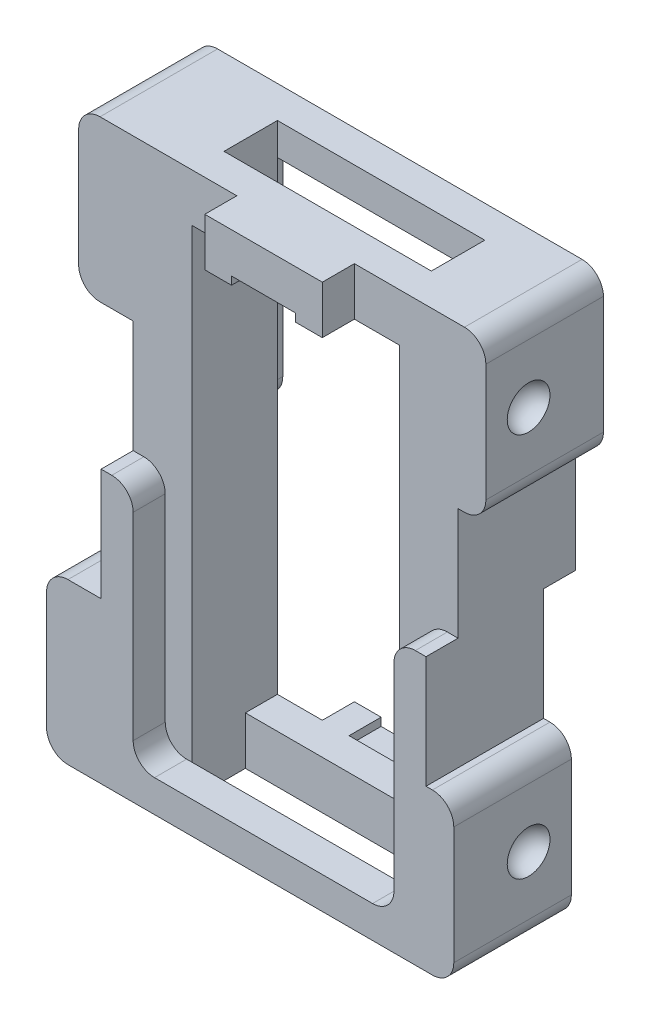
ISO-10303-21;
HEADER;
FILE_DESCRIPTION(('STEP AP214'),'2;1');
FILE_NAME('part.step','',(''),(''),'','','');
FILE_SCHEMA(('AUTOMOTIVE_DESIGN { 1 0 10303 214 1 1 1 1 }'));
ENDSEC;
DATA;
#1=APPLICATION_CONTEXT('core data for automotive mechanical design processes');
#2=APPLICATION_PROTOCOL_DEFINITION('international standard','automotive_design',2000,#1);
#3=PRODUCT_CONTEXT('',#1,'mechanical');
#4=PRODUCT('Part','Part','',(#3));
#5=PRODUCT_RELATED_PRODUCT_CATEGORY('part','',(#4));
#6=PRODUCT_DEFINITION_FORMATION('','',#4);
#7=PRODUCT_DEFINITION_CONTEXT('part definition',#1,'design');
#8=PRODUCT_DEFINITION('design','',#6,#7);
#9=PRODUCT_DEFINITION_SHAPE('','',#8);
#10=(LENGTH_UNIT() NAMED_UNIT(*) SI_UNIT(.MILLI.,.METRE.));
#11=(NAMED_UNIT(*) PLANE_ANGLE_UNIT() SI_UNIT($,.RADIAN.));
#12=(NAMED_UNIT(*) SI_UNIT($,.STERADIAN.) SOLID_ANGLE_UNIT());
#13=UNCERTAINTY_MEASURE_WITH_UNIT(LENGTH_MEASURE(1.E-05),#10,'distance_accuracy_value','');
#14=(GEOMETRIC_REPRESENTATION_CONTEXT(3) GLOBAL_UNCERTAINTY_ASSIGNED_CONTEXT((#13)) GLOBAL_UNIT_ASSIGNED_CONTEXT((#10,
#11,#12)) REPRESENTATION_CONTEXT('',''));
#15=CARTESIAN_POINT('',(0.,0.,0.));
#16=DIRECTION('',(0.,0.,1.));
#17=DIRECTION('',(1.,0.,0.));
#18=AXIS2_PLACEMENT_3D('',#15,#16,#17);
#19=CARTESIAN_POINT('',(0.,0.,4.));
#20=DIRECTION('',(0.,0.,1.));
#21=DIRECTION('',(1.,0.,0.));
#22=AXIS2_PLACEMENT_3D('',#19,#20,#21);
#23=PLANE('',#22);
#24=DIRECTION('',(0.,1.,0.));
#25=VECTOR('',#24,1.);
#26=CARTESIAN_POINT('',(9.7,21.,4.));
#27=LINE('',#26,#25);
#28=CARTESIAN_POINT('',(9.7,-22.5,4.));
#29=VERTEX_POINT('',#28);
#30=CARTESIAN_POINT('',(9.7,21.,4.));
#31=VERTEX_POINT('',#30);
#32=EDGE_CURVE('E869',#29,#31,#27,.T.);
#33=ORIENTED_EDGE('',*,*,#32,.F.);
#34=DIRECTION('',(-1.,0.,0.));
#35=VECTOR('',#34,1.);
#36=CARTESIAN_POINT('',(0.,-22.5,4.));
#37=LINE('',#36,#35);
#38=CARTESIAN_POINT('',(10.2,-22.5,4.));
#39=VERTEX_POINT('',#38);
#40=EDGE_CURVE('E858',#39,#29,#37,.T.);
#41=ORIENTED_EDGE('',*,*,#40,.F.);
#42=CARTESIAN_POINT('',(10.2,-20.5,4.));
#43=DIRECTION('',(0.,0.,1.));
#44=DIRECTION('',(1.,0.,0.));
#45=AXIS2_PLACEMENT_3D('',#42,#43,#44);
#46=CIRCLE('',#45,2.);
#47=CARTESIAN_POINT('',(12.2,-20.5,4.));
#48=VERTEX_POINT('',#47);
#49=EDGE_CURVE('E732',#39,#48,#46,.T.);
#50=ORIENTED_EDGE('',*,*,#49,.T.);
#51=DIRECTION('',(0.,-1.,0.));
#52=VECTOR('',#51,1.);
#53=CARTESIAN_POINT('',(12.2,0.,4.));
#54=LINE('',#53,#52);
#55=CARTESIAN_POINT('',(12.2,-2.,4.));
#56=VERTEX_POINT('',#55);
#57=EDGE_CURVE('E1209',#56,#48,#54,.T.);
#58=ORIENTED_EDGE('',*,*,#57,.F.);
#59=CARTESIAN_POINT('',(14.2,-2.,4.));
#60=DIRECTION('',(0.,0.,1.));
#61=DIRECTION('',(1.,0.,0.));
#62=AXIS2_PLACEMENT_3D('',#59,#60,#61);
#63=CIRCLE('',#62,2.);
#64=CARTESIAN_POINT('',(14.2,0.,4.));
#65=VERTEX_POINT('',#64);
#66=EDGE_CURVE('E819',#56,#65,#63,.F.);
#67=ORIENTED_EDGE('',*,*,#66,.T.);
#68=DIRECTION('',(-1.,0.,0.));
#69=VECTOR('',#68,1.);
#70=CARTESIAN_POINT('',(0.,0.,4.));
#71=LINE('',#70,#69);
#72=CARTESIAN_POINT('',(15.2,0.,4.));
#73=VERTEX_POINT('',#72);
#74=EDGE_CURVE('E1218',#73,#65,#71,.T.);
#75=ORIENTED_EDGE('',*,*,#74,.F.);
#76=DIRECTION('',(0.,1.,0.));
#77=VECTOR('',#76,1.);
#78=CARTESIAN_POINT('',(15.2,25.5,4.));
#79=LINE('',#78,#77);
#80=CARTESIAN_POINT('',(15.2,10.5,4.));
#81=VERTEX_POINT('',#80);
#82=EDGE_CURVE('E483',#73,#81,#79,.T.);
#83=ORIENTED_EDGE('',*,*,#82,.T.);
#84=DIRECTION('',(-1.,0.,0.));
#85=VECTOR('',#84,1.);
#86=CARTESIAN_POINT('',(17.8,10.5,4.));
#87=LINE('',#86,#85);
#88=CARTESIAN_POINT('',(15.8,10.5,4.));
#89=VERTEX_POINT('',#88);
#90=EDGE_CURVE('E549',#89,#81,#87,.T.);
#91=ORIENTED_EDGE('',*,*,#90,.F.);
#92=CARTESIAN_POINT('',(15.8,12.5,4.));
#93=DIRECTION('',(0.,0.,1.));
#94=DIRECTION('',(1.,0.,0.));
#95=AXIS2_PLACEMENT_3D('',#92,#93,#94);
#96=CIRCLE('',#95,2.);
#97=CARTESIAN_POINT('',(17.8,12.5,4.));
#98=VERTEX_POINT('',#97);
#99=EDGE_CURVE('E737',#89,#98,#96,.T.);
#100=ORIENTED_EDGE('',*,*,#99,.T.);
#101=DIRECTION('',(0.,-1.,0.));
#102=VECTOR('',#101,1.);
#103=CARTESIAN_POINT('',(17.8,25.5,4.));
#104=LINE('',#103,#102);
#105=CARTESIAN_POINT('',(17.8,23.5,4.));
#106=VERTEX_POINT('',#105);
#107=EDGE_CURVE('E1097',#106,#98,#104,.T.);
#108=ORIENTED_EDGE('',*,*,#107,.F.);
#109=CARTESIAN_POINT('',(15.8,23.5,4.));
#110=DIRECTION('',(0.,0.,1.));
#111=DIRECTION('',(1.,0.,0.));
#112=AXIS2_PLACEMENT_3D('',#109,#110,#111);
#113=CIRCLE('',#112,2.);
#114=CARTESIAN_POINT('',(15.8,25.5,4.));
#115=VERTEX_POINT('',#114);
#116=EDGE_CURVE('E730',#106,#115,#113,.T.);
#117=ORIENTED_EDGE('',*,*,#116,.T.);
#118=DIRECTION('',(-1.,0.,0.));
#119=VECTOR('',#118,1.);
#120=CARTESIAN_POINT('',(-15.2,25.5,4.));
#121=LINE('',#120,#119);
#122=CARTESIAN_POINT('',(5.5,25.5,4.));
#123=VERTEX_POINT('',#122);
#124=EDGE_CURVE('E488',#115,#123,#121,.T.);
#125=ORIENTED_EDGE('',*,*,#124,.T.);
#126=DIRECTION('',(0.,1.,0.));
#127=VECTOR('',#126,1.);
#128=CARTESIAN_POINT('',(5.5,0.,4.));
#129=LINE('',#128,#127);
#130=CARTESIAN_POINT('',(5.5,21.,4.));
#131=VERTEX_POINT('',#130);
#132=EDGE_CURVE('E914',#131,#123,#129,.T.);
#133=ORIENTED_EDGE('',*,*,#132,.F.);
#134=DIRECTION('',(-1.,0.,0.));
#135=VECTOR('',#134,1.);
#136=CARTESIAN_POINT('',(-9.7,21.,4.));
#137=LINE('',#136,#135);
#138=EDGE_CURVE('E873',#31,#131,#137,.T.);
#139=ORIENTED_EDGE('',*,*,#138,.F.);
#140=EDGE_LOOP('',(#33,#41,#50,#58,#67,#75,#83,#91,#100,#108,#117,#125,#133,#139));
#141=FACE_BOUND('',#140,.T.);
#142=ADVANCED_FACE('F33',(#141),#23,.T.);
#143=CARTESIAN_POINT('',(0.,0.,-4.));
#144=DIRECTION('',(0.,0.,1.));
#145=DIRECTION('',(1.,0.,0.));
#146=AXIS2_PLACEMENT_3D('',#143,#144,#145);
#147=PLANE('',#146);
#148=DIRECTION('',(-1.,0.,0.));
#149=VECTOR('',#148,1.);
#150=CARTESIAN_POINT('',(12.2,22.5,-4.));
#151=LINE('',#150,#149);
#152=CARTESIAN_POINT('',(-9.7,22.5,-4.));
#153=VERTEX_POINT('',#152);
#154=CARTESIAN_POINT('',(-10.2,22.5,-4.));
#155=VERTEX_POINT('',#154);
#156=EDGE_CURVE('E1154',#153,#155,#151,.T.);
#157=ORIENTED_EDGE('',*,*,#156,.F.);
#158=DIRECTION('',(0.,-1.,0.));
#159=VECTOR('',#158,1.);
#160=CARTESIAN_POINT('',(-9.7,21.,-4.));
#161=LINE('',#160,#159);
#162=CARTESIAN_POINT('',(-9.7,-21.,-4.));
#163=VERTEX_POINT('',#162);
#164=EDGE_CURVE('E857',#153,#163,#161,.T.);
#165=ORIENTED_EDGE('',*,*,#164,.T.);
#166=DIRECTION('',(1.,0.,0.));
#167=VECTOR('',#166,1.);
#168=CARTESIAN_POINT('',(-9.7,-21.,-4.));
#169=LINE('',#168,#167);
#170=CARTESIAN_POINT('',(-5.5,-21.,-4.));
#171=VERTEX_POINT('',#170);
#172=EDGE_CURVE('E877',#163,#171,#169,.T.);
#173=ORIENTED_EDGE('',*,*,#172,.T.);
#174=DIRECTION('',(0.,1.,0.));
#175=VECTOR('',#174,1.);
#176=CARTESIAN_POINT('',(-5.5,-25.5,-4.));
#177=LINE('',#176,#175);
#178=CARTESIAN_POINT('',(-5.5,-25.5,-4.));
#179=VERTEX_POINT('',#178);
#180=EDGE_CURVE('E598',#179,#171,#177,.T.);
#181=ORIENTED_EDGE('',*,*,#180,.F.);
#182=DIRECTION('',(1.,0.,0.));
#183=VECTOR('',#182,1.);
#184=CARTESIAN_POINT('',(-15.2,-25.5,-4.));
#185=LINE('',#184,#183);
#186=CARTESIAN_POINT('',(-18.3,-25.5,-4.));
#187=VERTEX_POINT('',#186);
#188=EDGE_CURVE('E493',#187,#179,#185,.T.);
#189=ORIENTED_EDGE('',*,*,#188,.F.);
#190=CARTESIAN_POINT('',(-18.3,-23.5,-4.));
#191=DIRECTION('',(0.,0.,1.));
#192=DIRECTION('',(1.,0.,0.));
#193=AXIS2_PLACEMENT_3D('',#190,#191,#192);
#194=CIRCLE('',#193,2.);
#195=CARTESIAN_POINT('',(-20.3,-23.5,-4.));
#196=VERTEX_POINT('',#195);
#197=EDGE_CURVE('E720',#187,#196,#194,.F.);
#198=ORIENTED_EDGE('',*,*,#197,.T.);
#199=DIRECTION('',(0.,-1.,0.));
#200=VECTOR('',#199,1.);
#201=CARTESIAN_POINT('',(-20.3,-25.5,-4.));
#202=LINE('',#201,#200);
#203=CARTESIAN_POINT('',(-20.3,-12.5,-4.));
#204=VERTEX_POINT('',#203);
#205=EDGE_CURVE('E574',#204,#196,#202,.T.);
#206=ORIENTED_EDGE('',*,*,#205,.F.);
#207=CARTESIAN_POINT('',(-18.3,-12.5,-4.));
#208=DIRECTION('',(0.,0.,1.));
#209=DIRECTION('',(1.,0.,0.));
#210=AXIS2_PLACEMENT_3D('',#207,#208,#209);
#211=CIRCLE('',#210,2.);
#212=CARTESIAN_POINT('',(-18.3,-10.5,-4.));
#213=VERTEX_POINT('',#212);
#214=EDGE_CURVE('E718',#204,#213,#211,.F.);
#215=ORIENTED_EDGE('',*,*,#214,.T.);
#216=DIRECTION('',(1.,0.,0.));
#217=VECTOR('',#216,1.);
#218=CARTESIAN_POINT('',(-20.3,-10.5,-4.));
#219=LINE('',#218,#217);
#220=CARTESIAN_POINT('',(-15.2,-10.5,-4.));
#221=VERTEX_POINT('',#220);
#222=EDGE_CURVE('E576',#213,#221,#219,.T.);
#223=ORIENTED_EDGE('',*,*,#222,.T.);
#224=DIRECTION('',(0.,-1.,0.));
#225=VECTOR('',#224,1.);
#226=CARTESIAN_POINT('',(-15.2,25.5,-4.));
#227=LINE('',#226,#225);
#228=CARTESIAN_POINT('',(-15.2,0.,-4.));
#229=VERTEX_POINT('',#228);
#230=EDGE_CURVE('E473',#229,#221,#227,.T.);
#231=ORIENTED_EDGE('',*,*,#230,.F.);
#232=DIRECTION('',(-1.,0.,0.));
#233=VECTOR('',#232,1.);
#234=CARTESIAN_POINT('',(-12.2,0.,-4.));
#235=LINE('',#234,#233);
#236=CARTESIAN_POINT('',(-14.2,0.,-4.));
#237=VERTEX_POINT('',#236);
#238=EDGE_CURVE('E504',#237,#229,#235,.T.);
#239=ORIENTED_EDGE('',*,*,#238,.F.);
#240=CARTESIAN_POINT('',(-14.2,2.,-4.));
#241=DIRECTION('',(0.,0.,1.));
#242=DIRECTION('',(1.,0.,0.));
#243=AXIS2_PLACEMENT_3D('',#240,#241,#242);
#244=CIRCLE('',#243,2.);
#245=CARTESIAN_POINT('',(-12.2,2.00000000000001,-4.));
#246=VERTEX_POINT('',#245);
#247=EDGE_CURVE('E823',#237,#246,#244,.T.);
#248=ORIENTED_EDGE('',*,*,#247,.T.);
#249=DIRECTION('',(0.,-1.,0.));
#250=VECTOR('',#249,1.);
#251=CARTESIAN_POINT('',(-12.2,22.5,-4.));
#252=LINE('',#251,#250);
#253=CARTESIAN_POINT('',(-12.2,20.5,-4.));
#254=VERTEX_POINT('',#253);
#255=EDGE_CURVE('E639',#254,#246,#252,.T.);
#256=ORIENTED_EDGE('',*,*,#255,.F.);
#257=CARTESIAN_POINT('',(-10.2,20.5,-4.));
#258=DIRECTION('',(0.,0.,1.));
#259=DIRECTION('',(1.,0.,0.));
#260=AXIS2_PLACEMENT_3D('',#257,#258,#259);
#261=CIRCLE('',#260,2.);
#262=EDGE_CURVE('E704',#254,#155,#261,.F.);
#263=ORIENTED_EDGE('',*,*,#262,.T.);
#264=EDGE_LOOP('',(#157,#165,#173,#181,#189,#198,#206,#215,#223,#231,#239,#248,#256,#263));
#265=FACE_BOUND('',#264,.T.);
#266=ADVANCED_FACE('F991',(#265),#147,.F.);
#267=CARTESIAN_POINT('',(17.8,0.,0.));
#268=DIRECTION('',(-1.,0.,0.));
#269=DIRECTION('',(0.,-1.,0.));
#270=AXIS2_PLACEMENT_3D('',#267,#268,#269);
#271=PLANE('',#270);
#272=ORIENTED_EDGE('',*,*,#107,.T.);
#273=DIRECTION('',(0.,0.,-1.));
#274=VECTOR('',#273,1.);
#275=CARTESIAN_POINT('',(17.8,12.5,0.));
#276=LINE('',#275,#274);
#277=CARTESIAN_POINT('',(17.8,12.5,-7.));
#278=VERTEX_POINT('',#277);
#279=EDGE_CURVE('E764',#98,#278,#276,.T.);
#280=ORIENTED_EDGE('',*,*,#279,.T.);
#281=DIRECTION('',(0.,1.,0.));
#282=VECTOR('',#281,1.);
#283=CARTESIAN_POINT('',(17.8,25.5,-7.));
#284=LINE('',#283,#282);
#285=CARTESIAN_POINT('',(17.8,23.5,-7.));
#286=VERTEX_POINT('',#285);
#287=EDGE_CURVE('E1091',#278,#286,#284,.T.);
#288=ORIENTED_EDGE('',*,*,#287,.T.);
#289=DIRECTION('',(0.,0.,1.));
#290=VECTOR('',#289,1.);
#291=CARTESIAN_POINT('',(17.8,23.5,0.));
#292=LINE('',#291,#290);
#293=EDGE_CURVE('E761',#286,#106,#292,.T.);
#294=ORIENTED_EDGE('',*,*,#293,.T.);
#295=EDGE_LOOP('',(#272,#280,#288,#294));
#296=FACE_BOUND('',#295,.T.);
#297=CARTESIAN_POINT('',(17.8,18.,0.));
#298=DIRECTION('',(-1.,0.,0.));
#299=DIRECTION('',(0.,-1.,0.));
#300=AXIS2_PLACEMENT_3D('',#297,#298,#299);
#301=CIRCLE('',#300,2.);
#302=CARTESIAN_POINT('',(17.8,16.,0.));
#303=VERTEX_POINT('',#302);
#304=EDGE_CURVE('E675',#303,#303,#301,.F.);
#305=ORIENTED_EDGE('',*,*,#304,.F.);
#306=EDGE_LOOP('',(#305));
#307=FACE_BOUND('',#306,.T.);
#308=ADVANCED_FACE('F997',(#296,#307),#271,.F.);
#309=CARTESIAN_POINT('',(17.8,0.,0.));
#310=DIRECTION('',(1.,0.,0.));
#311=DIRECTION('',(0.,1.,0.));
#312=AXIS2_PLACEMENT_3D('',#309,#310,#311);
#313=PLANE('',#312);
#314=DIRECTION('',(0.,1.,0.));
#315=VECTOR('',#314,1.);
#316=CARTESIAN_POINT('',(17.8,-25.5,-4.));
#317=LINE('',#316,#315);
#318=CARTESIAN_POINT('',(17.8,-23.5,-4.));
#319=VERTEX_POINT('',#318);
#320=CARTESIAN_POINT('',(17.8,-12.5,-4.));
#321=VERTEX_POINT('',#320);
#322=EDGE_CURVE('E548',#319,#321,#317,.T.);
#323=ORIENTED_EDGE('',*,*,#322,.T.);
#324=DIRECTION('',(0.,0.,1.));
#325=VECTOR('',#324,1.);
#326=CARTESIAN_POINT('',(17.8,-12.5,7.));
#327=LINE('',#326,#325);
#328=CARTESIAN_POINT('',(17.8,-12.5,7.));
#329=VERTEX_POINT('',#328);
#330=EDGE_CURVE('E772',#321,#329,#327,.T.);
#331=ORIENTED_EDGE('',*,*,#330,.T.);
#332=DIRECTION('',(0.,-1.,0.));
#333=VECTOR('',#332,1.);
#334=CARTESIAN_POINT('',(17.8,-25.5,7.));
#335=LINE('',#334,#333);
#336=CARTESIAN_POINT('',(17.8,-23.5,7.));
#337=VERTEX_POINT('',#336);
#338=EDGE_CURVE('E555',#329,#337,#335,.T.);
#339=ORIENTED_EDGE('',*,*,#338,.T.);
#340=DIRECTION('',(0.,0.,-1.));
#341=VECTOR('',#340,1.);
#342=CARTESIAN_POINT('',(17.8,-23.5,-4.));
#343=LINE('',#342,#341);
#344=EDGE_CURVE('E769',#337,#319,#343,.T.);
#345=ORIENTED_EDGE('',*,*,#344,.T.);
#346=EDGE_LOOP('',(#323,#331,#339,#345));
#347=FACE_BOUND('',#346,.T.);
#348=CARTESIAN_POINT('',(17.8,-18.,0.));
#349=DIRECTION('',(1.,0.,0.));
#350=DIRECTION('',(0.,1.,0.));
#351=AXIS2_PLACEMENT_3D('',#348,#349,#350);
#352=CIRCLE('',#351,2.);
#353=CARTESIAN_POINT('',(17.8,-16.,0.));
#354=VERTEX_POINT('',#353);
#355=EDGE_CURVE('E671',#354,#354,#352,.F.);
#356=ORIENTED_EDGE('',*,*,#355,.T.);
#357=EDGE_LOOP('',(#356));
#358=FACE_BOUND('',#357,.T.);
#359=ADVANCED_FACE('F1113',(#347,#358),#313,.T.);
#360=CARTESIAN_POINT('',(15.2,25.5,4.));
#361=DIRECTION('',(-1.,0.,0.));
#362=DIRECTION('',(0.,-1.,0.));
#363=AXIS2_PLACEMENT_3D('',#360,#361,#362);
#364=PLANE('',#363);
#365=DIRECTION('',(0.,0.,-1.));
#366=VECTOR('',#365,1.);
#367=CARTESIAN_POINT('',(15.2,10.5,-7.));
#368=LINE('',#367,#366);
#369=CARTESIAN_POINT('',(15.2,10.5,-7.));
#370=VERTEX_POINT('',#369);
#371=EDGE_CURVE('E674',#81,#370,#368,.T.);
#372=ORIENTED_EDGE('',*,*,#371,.F.);
#373=ORIENTED_EDGE('',*,*,#82,.F.);
#374=DIRECTION('',(0.,0.,1.));
#375=VECTOR('',#374,1.);
#376=CARTESIAN_POINT('',(15.2,0.,-43.6788356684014));
#377=LINE('',#376,#375);
#378=CARTESIAN_POINT('',(15.2,0.,7.));
#379=VERTEX_POINT('',#378);
#380=EDGE_CURVE('E1214',#73,#379,#377,.T.);
#381=ORIENTED_EDGE('',*,*,#380,.T.);
#382=DIRECTION('',(0.,1.,0.));
#383=VECTOR('',#382,1.);
#384=CARTESIAN_POINT('',(15.2,-25.5,7.));
#385=LINE('',#384,#383);
#386=CARTESIAN_POINT('',(15.2,-10.5,7.));
#387=VERTEX_POINT('',#386);
#388=EDGE_CURVE('E534',#387,#379,#385,.T.);
#389=ORIENTED_EDGE('',*,*,#388,.F.);
#390=DIRECTION('',(0.,0.,1.));
#391=VECTOR('',#390,1.);
#392=CARTESIAN_POINT('',(15.2,-10.5,-4.));
#393=LINE('',#392,#391);
#394=CARTESIAN_POINT('',(15.2,-10.5,-4.));
#395=VERTEX_POINT('',#394);
#396=EDGE_CURVE('E544',#395,#387,#393,.T.);
#397=ORIENTED_EDGE('',*,*,#396,.F.);
#398=DIRECTION('',(0.,1.,0.));
#399=VECTOR('',#398,1.);
#400=CARTESIAN_POINT('',(15.2,25.5,-4.));
#401=LINE('',#400,#399);
#402=CARTESIAN_POINT('',(15.2,0.,-4.));
#403=VERTEX_POINT('',#402);
#404=EDGE_CURVE('E484',#395,#403,#401,.T.);
#405=ORIENTED_EDGE('',*,*,#404,.T.);
#406=DIRECTION('',(0.,0.,1.));
#407=VECTOR('',#406,1.);
#408=CARTESIAN_POINT('',(15.2,0.,-7.));
#409=LINE('',#408,#407);
#410=CARTESIAN_POINT('',(15.2,0.,-7.));
#411=VERTEX_POINT('',#410);
#412=EDGE_CURVE('E507',#411,#403,#409,.T.);
#413=ORIENTED_EDGE('',*,*,#412,.F.);
#414=DIRECTION('',(0.,-1.,0.));
#415=VECTOR('',#414,1.);
#416=CARTESIAN_POINT('',(15.2,25.5,-7.));
#417=LINE('',#416,#415);
#418=EDGE_CURVE('E645',#370,#411,#417,.T.);
#419=ORIENTED_EDGE('',*,*,#418,.F.);
#420=EDGE_LOOP('',(#372,#373,#381,#389,#397,#405,#413,#419));
#421=FACE_BOUND('',#420,.T.);
#422=ADVANCED_FACE('F1017',(#421),#364,.F.);
#423=CARTESIAN_POINT('',(-15.2,25.5,4.));
#424=DIRECTION('',(1.,0.,0.));
#425=DIRECTION('',(0.,0.,-1.));
#426=AXIS2_PLACEMENT_3D('',#423,#424,#425);
#427=PLANE('',#426);
#428=DIRECTION('',(0.,0.,1.));
#429=VECTOR('',#428,1.);
#430=CARTESIAN_POINT('',(-15.2,10.5,-7.));
#431=LINE('',#430,#429);
#432=CARTESIAN_POINT('',(-15.2,10.5,-7.));
#433=VERTEX_POINT('',#432);
#434=CARTESIAN_POINT('',(-15.2,10.5,4.));
#435=VERTEX_POINT('',#434);
#436=EDGE_CURVE('E561',#433,#435,#431,.T.);
#437=ORIENTED_EDGE('',*,*,#436,.F.);
#438=DIRECTION('',(0.,1.,0.));
#439=VECTOR('',#438,1.);
#440=CARTESIAN_POINT('',(-15.2,0.,-7.));
#441=LINE('',#440,#439);
#442=CARTESIAN_POINT('',(-15.2,0.,-7.));
#443=VERTEX_POINT('',#442);
#444=EDGE_CURVE('E638',#443,#433,#441,.T.);
#445=ORIENTED_EDGE('',*,*,#444,.F.);
#446=DIRECTION('',(0.,0.,1.));
#447=VECTOR('',#446,1.);
#448=CARTESIAN_POINT('',(-15.2,0.,-7.));
#449=LINE('',#448,#447);
#450=EDGE_CURVE('E510',#443,#229,#449,.T.);
#451=ORIENTED_EDGE('',*,*,#450,.T.);
#452=ORIENTED_EDGE('',*,*,#230,.T.);
#453=DIRECTION('',(0.,0.,-1.));
#454=VECTOR('',#453,1.);
#455=CARTESIAN_POINT('',(-15.2,-10.5,7.));
#456=LINE('',#455,#454);
#457=CARTESIAN_POINT('',(-15.2,-10.5,7.));
#458=VERTEX_POINT('',#457);
#459=EDGE_CURVE('E525',#458,#221,#456,.T.);
#460=ORIENTED_EDGE('',*,*,#459,.F.);
#461=DIRECTION('',(0.,-1.,0.));
#462=VECTOR('',#461,1.);
#463=CARTESIAN_POINT('',(-15.2,0.,7.));
#464=LINE('',#463,#462);
#465=CARTESIAN_POINT('',(-15.2,0.,7.));
#466=VERTEX_POINT('',#465);
#467=EDGE_CURVE('E519',#466,#458,#464,.T.);
#468=ORIENTED_EDGE('',*,*,#467,.F.);
#469=DIRECTION('',(0.,0.,1.));
#470=VECTOR('',#469,1.);
#471=CARTESIAN_POINT('',(-15.2,0.,-43.6788356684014));
#472=LINE('',#471,#470);
#473=CARTESIAN_POINT('',(-15.2,0.,4.));
#474=VERTEX_POINT('',#473);
#475=EDGE_CURVE('E1215',#474,#466,#472,.T.);
#476=ORIENTED_EDGE('',*,*,#475,.F.);
#477=DIRECTION('',(0.,-1.,0.));
#478=VECTOR('',#477,1.);
#479=CARTESIAN_POINT('',(-15.2,25.5,4.));
#480=LINE('',#479,#478);
#481=EDGE_CURVE('E480',#435,#474,#480,.T.);
#482=ORIENTED_EDGE('',*,*,#481,.F.);
#483=EDGE_LOOP('',(#437,#445,#451,#452,#460,#468,#476,#482));
#484=FACE_BOUND('',#483,.T.);
#485=ADVANCED_FACE('F1018',(#484),#427,.F.);
#486=DIRECTION('',(0.,1.,0.));
#487=VECTOR('',#486,1.);
#488=CARTESIAN_POINT('',(9.7,21.,-4.));
#489=LINE('',#488,#487);
#490=CARTESIAN_POINT('',(9.70000000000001,-21.,-4.));
#491=VERTEX_POINT('',#490);
#492=CARTESIAN_POINT('',(9.7,22.5,-4.));
#493=VERTEX_POINT('',#492);
#494=EDGE_CURVE('E470',#491,#493,#489,.T.);
#495=ORIENTED_EDGE('',*,*,#494,.T.);
#496=CARTESIAN_POINT('',(10.2,22.5,-4.));
#497=VERTEX_POINT('',#496);
#498=EDGE_CURVE('E1253',#497,#493,#151,.T.);
#499=ORIENTED_EDGE('',*,*,#498,.F.);
#500=CARTESIAN_POINT('',(10.2,20.5,-4.));
#501=DIRECTION('',(0.,0.,1.));
#502=DIRECTION('',(1.,0.,0.));
#503=AXIS2_PLACEMENT_3D('',#500,#501,#502);
#504=CIRCLE('',#503,2.);
#505=CARTESIAN_POINT('',(12.2,20.5,-4.));
#506=VERTEX_POINT('',#505);
#507=EDGE_CURVE('E709',#497,#506,#504,.F.);
#508=ORIENTED_EDGE('',*,*,#507,.T.);
#509=DIRECTION('',(0.,1.,0.));
#510=VECTOR('',#509,1.);
#511=CARTESIAN_POINT('',(12.2,0.,-4.));
#512=LINE('',#511,#510);
#513=CARTESIAN_POINT('',(12.2,2.,-4.));
#514=VERTEX_POINT('',#513);
#515=EDGE_CURVE('E503',#514,#506,#512,.T.);
#516=ORIENTED_EDGE('',*,*,#515,.F.);
#517=CARTESIAN_POINT('',(14.2,2.,-4.));
#518=DIRECTION('',(0.,0.,1.));
#519=DIRECTION('',(1.,0.,0.));
#520=AXIS2_PLACEMENT_3D('',#517,#518,#519);
#521=CIRCLE('',#520,2.);
#522=CARTESIAN_POINT('',(14.2,0.,-4.));
#523=VERTEX_POINT('',#522);
#524=EDGE_CURVE('E821',#514,#523,#521,.T.);
#525=ORIENTED_EDGE('',*,*,#524,.T.);
#526=DIRECTION('',(-1.,0.,0.));
#527=VECTOR('',#526,1.);
#528=CARTESIAN_POINT('',(15.2,0.,-4.));
#529=LINE('',#528,#527);
#530=EDGE_CURVE('E500',#403,#523,#529,.T.);
#531=ORIENTED_EDGE('',*,*,#530,.F.);
#532=ORIENTED_EDGE('',*,*,#404,.F.);
#533=DIRECTION('',(-1.,0.,0.));
#534=VECTOR('',#533,1.);
#535=CARTESIAN_POINT('',(17.8,-10.5,-4.));
#536=LINE('',#535,#534);
#537=CARTESIAN_POINT('',(15.8,-10.5,-4.));
#538=VERTEX_POINT('',#537);
#539=EDGE_CURVE('E567',#538,#395,#536,.T.);
#540=ORIENTED_EDGE('',*,*,#539,.F.);
#541=CARTESIAN_POINT('',(15.8,-12.5,-4.));
#542=DIRECTION('',(0.,0.,1.));
#543=DIRECTION('',(1.,0.,0.));
#544=AXIS2_PLACEMENT_3D('',#541,#542,#543);
#545=CIRCLE('',#544,2.);
#546=EDGE_CURVE('E714',#538,#321,#545,.F.);
#547=ORIENTED_EDGE('',*,*,#546,.T.);
#548=ORIENTED_EDGE('',*,*,#322,.F.);
#549=CARTESIAN_POINT('',(15.8,-23.5,-4.));
#550=DIRECTION('',(0.,0.,1.));
#551=DIRECTION('',(1.,0.,0.));
#552=AXIS2_PLACEMENT_3D('',#549,#550,#551);
#553=CIRCLE('',#552,2.);
#554=CARTESIAN_POINT('',(15.8,-25.5,-4.));
#555=VERTEX_POINT('',#554);
#556=EDGE_CURVE('E667',#319,#555,#553,.F.);
#557=ORIENTED_EDGE('',*,*,#556,.T.);
#558=CARTESIAN_POINT('',(5.49999999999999,-25.5,-4.));
#559=VERTEX_POINT('',#558);
#560=EDGE_CURVE('E498',#559,#555,#185,.T.);
#561=ORIENTED_EDGE('',*,*,#560,.F.);
#562=DIRECTION('',(0.,-1.,0.));
#563=VECTOR('',#562,1.);
#564=CARTESIAN_POINT('',(5.5,-21.,-4.));
#565=LINE('',#564,#563);
#566=CARTESIAN_POINT('',(5.5,-21.,-4.));
#567=VERTEX_POINT('',#566);
#568=EDGE_CURVE('E583',#567,#559,#565,.T.);
#569=ORIENTED_EDGE('',*,*,#568,.F.);
#570=EDGE_CURVE('E861',#567,#491,#169,.T.);
#571=ORIENTED_EDGE('',*,*,#570,.T.);
#572=EDGE_LOOP('',(#495,#499,#508,#516,#525,#531,#532,#540,#547,#548,#557,#561,#569,#571));
#573=FACE_BOUND('',#572,.T.);
#574=ADVANCED_FACE('F1000',(#573),#147,.F.);
#575=DIRECTION('',(0.,-1.,0.));
#576=VECTOR('',#575,1.);
#577=CARTESIAN_POINT('',(-3.,-21.,-4.));
#578=LINE('',#577,#576);
#579=CARTESIAN_POINT('',(-3.,-21.,-4.));
#580=VERTEX_POINT('',#579);
#581=CARTESIAN_POINT('',(-3.,-21.75,-4.));
#582=VERTEX_POINT('',#581);
#583=EDGE_CURVE('E601',#580,#582,#578,.T.);
#584=ORIENTED_EDGE('',*,*,#583,.F.);
#585=CARTESIAN_POINT('',(3.,-21.,-4.));
#586=VERTEX_POINT('',#585);
#587=EDGE_CURVE('E879',#580,#586,#169,.T.);
#588=ORIENTED_EDGE('',*,*,#587,.T.);
#589=DIRECTION('',(0.,1.,0.));
#590=VECTOR('',#589,1.);
#591=CARTESIAN_POINT('',(3.,-21.75,-4.));
#592=LINE('',#591,#590);
#593=CARTESIAN_POINT('',(3.,-21.75,-4.));
#594=VERTEX_POINT('',#593);
#595=EDGE_CURVE('E608',#594,#586,#592,.T.);
#596=ORIENTED_EDGE('',*,*,#595,.F.);
#597=DIRECTION('',(1.,0.,0.));
#598=VECTOR('',#597,1.);
#599=CARTESIAN_POINT('',(-3.,-21.75,-4.));
#600=LINE('',#599,#598);
#601=EDGE_CURVE('E605',#582,#594,#600,.T.);
#602=ORIENTED_EDGE('',*,*,#601,.F.);
#603=EDGE_LOOP('',(#584,#588,#596,#602));
#604=FACE_BOUND('',#603,.T.);
#605=ADVANCED_FACE('F999',(#604),#147,.F.);
#606=CARTESIAN_POINT('',(-9.7,-22.5,4.));
#607=VERTEX_POINT('',#606);
#608=CARTESIAN_POINT('',(-10.2,-22.5,4.));
#609=VERTEX_POINT('',#608);
#610=EDGE_CURVE('E852',#607,#609,#37,.T.);
#611=ORIENTED_EDGE('',*,*,#610,.F.);
#612=DIRECTION('',(0.,-1.,0.));
#613=VECTOR('',#612,1.);
#614=CARTESIAN_POINT('',(-9.7,21.,4.));
#615=LINE('',#614,#613);
#616=CARTESIAN_POINT('',(-9.7,21.,4.));
#617=VERTEX_POINT('',#616);
#618=EDGE_CURVE('E55',#617,#607,#615,.T.);
#619=ORIENTED_EDGE('',*,*,#618,.F.);
#620=CARTESIAN_POINT('',(-5.5,21.,4.));
#621=VERTEX_POINT('',#620);
#622=EDGE_CURVE('E872',#621,#617,#137,.T.);
#623=ORIENTED_EDGE('',*,*,#622,.F.);
#624=DIRECTION('',(0.,-1.,0.));
#625=VECTOR('',#624,1.);
#626=CARTESIAN_POINT('',(-5.49999999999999,0.,4.));
#627=LINE('',#626,#625);
#628=CARTESIAN_POINT('',(-5.5,25.5,4.));
#629=VERTEX_POINT('',#628);
#630=EDGE_CURVE('E893',#629,#621,#627,.T.);
#631=ORIENTED_EDGE('',*,*,#630,.F.);
#632=CARTESIAN_POINT('',(-18.3,25.5,4.));
#633=VERTEX_POINT('',#632);
#634=EDGE_CURVE('E487',#629,#633,#121,.T.);
#635=ORIENTED_EDGE('',*,*,#634,.T.);
#636=CARTESIAN_POINT('',(-18.3,23.5,4.));
#637=DIRECTION('',(0.,0.,1.));
#638=DIRECTION('',(1.,0.,0.));
#639=AXIS2_PLACEMENT_3D('',#636,#637,#638);
#640=CIRCLE('',#639,2.);
#641=CARTESIAN_POINT('',(-20.3,23.5,4.));
#642=VERTEX_POINT('',#641);
#643=EDGE_CURVE('E739',#633,#642,#640,.T.);
#644=ORIENTED_EDGE('',*,*,#643,.T.);
#645=DIRECTION('',(0.,1.,0.));
#646=VECTOR('',#645,1.);
#647=CARTESIAN_POINT('',(-20.3,25.5,4.));
#648=LINE('',#647,#646);
#649=CARTESIAN_POINT('',(-20.3,12.5,4.));
#650=VERTEX_POINT('',#649);
#651=EDGE_CURVE('E560',#650,#642,#648,.T.);
#652=ORIENTED_EDGE('',*,*,#651,.F.);
#653=CARTESIAN_POINT('',(-18.3,12.5,4.));
#654=DIRECTION('',(0.,0.,1.));
#655=DIRECTION('',(1.,0.,0.));
#656=AXIS2_PLACEMENT_3D('',#653,#654,#655);
#657=CIRCLE('',#656,2.);
#658=CARTESIAN_POINT('',(-18.3,10.5,4.));
#659=VERTEX_POINT('',#658);
#660=EDGE_CURVE('E741',#650,#659,#657,.T.);
#661=ORIENTED_EDGE('',*,*,#660,.T.);
#662=DIRECTION('',(1.,0.,0.));
#663=VECTOR('',#662,1.);
#664=CARTESIAN_POINT('',(-20.3,10.5,4.));
#665=LINE('',#664,#663);
#666=EDGE_CURVE('E564',#659,#435,#665,.T.);
#667=ORIENTED_EDGE('',*,*,#666,.T.);
#668=ORIENTED_EDGE('',*,*,#481,.T.);
#669=DIRECTION('',(-1.,0.,0.));
#670=VECTOR('',#669,1.);
#671=CARTESIAN_POINT('',(0.,0.,4.));
#672=LINE('',#671,#670);
#673=CARTESIAN_POINT('',(-14.2,0.,4.));
#674=VERTEX_POINT('',#673);
#675=EDGE_CURVE('E1223',#674,#474,#672,.T.);
#676=ORIENTED_EDGE('',*,*,#675,.F.);
#677=CARTESIAN_POINT('',(-14.2,-2.00000000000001,4.));
#678=DIRECTION('',(0.,0.,1.));
#679=DIRECTION('',(1.,0.,0.));
#680=AXIS2_PLACEMENT_3D('',#677,#678,#679);
#681=CIRCLE('',#680,2.);
#682=CARTESIAN_POINT('',(-12.2,-2.00000000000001,4.));
#683=VERTEX_POINT('',#682);
#684=EDGE_CURVE('E817',#674,#683,#681,.F.);
#685=ORIENTED_EDGE('',*,*,#684,.T.);
#686=DIRECTION('',(0.,1.,0.));
#687=VECTOR('',#686,1.);
#688=CARTESIAN_POINT('',(-12.2,0.,4.));
#689=LINE('',#688,#687);
#690=CARTESIAN_POINT('',(-12.2,-20.5,4.));
#691=VERTEX_POINT('',#690);
#692=EDGE_CURVE('E854',#691,#683,#689,.T.);
#693=ORIENTED_EDGE('',*,*,#692,.F.);
#694=CARTESIAN_POINT('',(-10.2,-20.5,4.));
#695=DIRECTION('',(0.,0.,1.));
#696=DIRECTION('',(1.,0.,0.));
#697=AXIS2_PLACEMENT_3D('',#694,#695,#696);
#698=CIRCLE('',#697,2.);
#699=EDGE_CURVE('E734',#691,#609,#698,.T.);
#700=ORIENTED_EDGE('',*,*,#699,.T.);
#701=EDGE_LOOP('',(#611,#619,#623,#631,#635,#644,#652,#661,#667,#668,#676,#685,#693,#700));
#702=FACE_BOUND('',#701,.T.);
#703=ADVANCED_FACE('F851',(#702),#23,.T.);
#704=DIRECTION('',(0.,-1.,0.));
#705=VECTOR('',#704,1.);
#706=CARTESIAN_POINT('',(3.00000000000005,0.,4.));
#707=LINE('',#706,#705);
#708=CARTESIAN_POINT('',(3.,21.75,4.));
#709=VERTEX_POINT('',#708);
#710=CARTESIAN_POINT('',(3.00000000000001,21.,4.));
#711=VERTEX_POINT('',#710);
#712=EDGE_CURVE('E908',#709,#711,#707,.T.);
#713=ORIENTED_EDGE('',*,*,#712,.F.);
#714=DIRECTION('',(1.,0.,0.));
#715=VECTOR('',#714,1.);
#716=CARTESIAN_POINT('',(0.,21.75,4.));
#717=LINE('',#716,#715);
#718=CARTESIAN_POINT('',(-3.,21.75,4.));
#719=VERTEX_POINT('',#718);
#720=EDGE_CURVE('E524',#719,#709,#717,.T.);
#721=ORIENTED_EDGE('',*,*,#720,.F.);
#722=DIRECTION('',(0.,1.,0.));
#723=VECTOR('',#722,1.);
#724=CARTESIAN_POINT('',(-3.,0.,4.));
#725=LINE('',#724,#723);
#726=CARTESIAN_POINT('',(-3.,21.,4.));
#727=VERTEX_POINT('',#726);
#728=EDGE_CURVE('E909',#727,#719,#725,.T.);
#729=ORIENTED_EDGE('',*,*,#728,.F.);
#730=EDGE_CURVE('E875',#711,#727,#137,.T.);
#731=ORIENTED_EDGE('',*,*,#730,.F.);
#732=EDGE_LOOP('',(#713,#721,#729,#731));
#733=FACE_BOUND('',#732,.T.);
#734=ADVANCED_FACE('F906',(#733),#23,.T.);
#735=CARTESIAN_POINT('',(-15.2,-25.5,4.));
#736=DIRECTION('',(0.,1.,0.));
#737=DIRECTION('',(-1.,0.,0.));
#738=AXIS2_PLACEMENT_3D('',#735,#736,#737);
#739=PLANE('',#738);
#740=DIRECTION('',(0.,0.,1.));
#741=VECTOR('',#740,1.);
#742=CARTESIAN_POINT('',(9.7,-25.5,4.));
#743=LINE('',#742,#741);
#744=CARTESIAN_POINT('',(9.7,-25.5,-1.));
#745=VERTEX_POINT('',#744);
#746=CARTESIAN_POINT('',(9.7,-25.5,4.));
#747=VERTEX_POINT('',#746);
#748=EDGE_CURVE('E1191',#745,#747,#743,.T.);
#749=ORIENTED_EDGE('',*,*,#748,.F.);
#750=DIRECTION('',(1.,0.,0.));
#751=VECTOR('',#750,1.);
#752=CARTESIAN_POINT('',(-9.7,-25.5,-1.));
#753=LINE('',#752,#751);
#754=CARTESIAN_POINT('',(-9.7,-25.5,-1.));
#755=VERTEX_POINT('',#754);
#756=EDGE_CURVE('E451',#755,#745,#753,.T.);
#757=ORIENTED_EDGE('',*,*,#756,.F.);
#758=DIRECTION('',(0.,0.,-1.));
#759=VECTOR('',#758,1.);
#760=CARTESIAN_POINT('',(-9.7,-25.5,4.));
#761=LINE('',#760,#759);
#762=CARTESIAN_POINT('',(-9.7,-25.5,4.));
#763=VERTEX_POINT('',#762);
#764=EDGE_CURVE('E1188',#763,#755,#761,.T.);
#765=ORIENTED_EDGE('',*,*,#764,.F.);
#766=DIRECTION('',(-1.,0.,0.));
#767=VECTOR('',#766,1.);
#768=CARTESIAN_POINT('',(-9.7,-25.5,4.));
#769=LINE('',#768,#767);
#770=EDGE_CURVE('E48',#747,#763,#769,.T.);
#771=ORIENTED_EDGE('',*,*,#770,.F.);
#772=EDGE_LOOP('',(#749,#757,#765,#771));
#773=FACE_BOUND('',#772,.T.);
#774=DIRECTION('',(1.,0.,0.));
#775=VECTOR('',#774,1.);
#776=CARTESIAN_POINT('',(-15.2,-25.5,7.));
#777=LINE('',#776,#775);
#778=CARTESIAN_POINT('',(-18.3,-25.5,7.));
#779=VERTEX_POINT('',#778);
#780=CARTESIAN_POINT('',(15.8,-25.5,7.));
#781=VERTEX_POINT('',#780);
#782=EDGE_CURVE('E523',#779,#781,#777,.T.);
#783=ORIENTED_EDGE('',*,*,#782,.F.);
#784=DIRECTION('',(0.,0.,1.));
#785=VECTOR('',#784,1.);
#786=CARTESIAN_POINT('',(-18.3,-25.5,-4.));
#787=LINE('',#786,#785);
#788=EDGE_CURVE('E699',#779,#187,#787,.F.);
#789=ORIENTED_EDGE('',*,*,#788,.T.);
#790=ORIENTED_EDGE('',*,*,#188,.T.);
#791=DIRECTION('',(0.,0.,1.));
#792=VECTOR('',#791,1.);
#793=CARTESIAN_POINT('',(-5.5,-25.5,-7.));
#794=LINE('',#793,#792);
#795=CARTESIAN_POINT('',(-5.5,-25.5,-7.));
#796=VERTEX_POINT('',#795);
#797=EDGE_CURVE('E633',#796,#179,#794,.T.);
#798=ORIENTED_EDGE('',*,*,#797,.F.);
#799=DIRECTION('',(-1.,0.,0.));
#800=VECTOR('',#799,1.);
#801=CARTESIAN_POINT('',(5.5,-25.5,-7.));
#802=LINE('',#801,#800);
#803=CARTESIAN_POINT('',(5.5,-25.5,-7.));
#804=VERTEX_POINT('',#803);
#805=EDGE_CURVE('E579',#804,#796,#802,.T.);
#806=ORIENTED_EDGE('',*,*,#805,.F.);
#807=DIRECTION('',(0.,0.,1.));
#808=VECTOR('',#807,1.);
#809=CARTESIAN_POINT('',(5.5,-25.5,-7.));
#810=LINE('',#809,#808);
#811=EDGE_CURVE('E597',#804,#559,#810,.T.);
#812=ORIENTED_EDGE('',*,*,#811,.T.);
#813=ORIENTED_EDGE('',*,*,#560,.T.);
#814=DIRECTION('',(0.,0.,-1.));
#815=VECTOR('',#814,1.);
#816=CARTESIAN_POINT('',(15.8,-25.5,7.));
#817=LINE('',#816,#815);
#818=EDGE_CURVE('E698',#555,#781,#817,.F.);
#819=ORIENTED_EDGE('',*,*,#818,.T.);
#820=EDGE_LOOP('',(#783,#789,#790,#798,#806,#812,#813,#819));
#821=FACE_BOUND('',#820,.T.);
#822=ADVANCED_FACE('F1004',(#773,#821),#739,.F.);
#823=CARTESIAN_POINT('',(-15.2,25.5,4.));
#824=DIRECTION('',(0.,-1.,0.));
#825=DIRECTION('',(1.,0.,0.));
#826=AXIS2_PLACEMENT_3D('',#823,#824,#825);
#827=PLANE('',#826);
#828=DIRECTION('',(1.,0.,0.));
#829=VECTOR('',#828,1.);
#830=CARTESIAN_POINT('',(9.7,25.5,1.));
#831=LINE('',#830,#829);
#832=CARTESIAN_POINT('',(-9.7,25.5,1.));
#833=VERTEX_POINT('',#832);
#834=CARTESIAN_POINT('',(9.7,25.5,1.));
#835=VERTEX_POINT('',#834);
#836=EDGE_CURVE('E1174',#833,#835,#831,.T.);
#837=ORIENTED_EDGE('',*,*,#836,.F.);
#838=DIRECTION('',(0.,0.,1.));
#839=VECTOR('',#838,1.);
#840=CARTESIAN_POINT('',(-9.7,25.5,1.));
#841=LINE('',#840,#839);
#842=CARTESIAN_POINT('',(-9.7,25.5,-4.));
#843=VERTEX_POINT('',#842);
#844=EDGE_CURVE('E1177',#843,#833,#841,.T.);
#845=ORIENTED_EDGE('',*,*,#844,.F.);
#846=DIRECTION('',(-1.,0.,0.));
#847=VECTOR('',#846,1.);
#848=CARTESIAN_POINT('',(9.7,25.5,-4.));
#849=LINE('',#848,#847);
#850=CARTESIAN_POINT('',(9.7,25.5,-4.));
#851=VERTEX_POINT('',#850);
#852=EDGE_CURVE('E1163',#851,#843,#849,.T.);
#853=ORIENTED_EDGE('',*,*,#852,.F.);
#854=DIRECTION('',(0.,0.,-1.));
#855=VECTOR('',#854,1.);
#856=CARTESIAN_POINT('',(9.7,25.5,1.));
#857=LINE('',#856,#855);
#858=EDGE_CURVE('E1171',#835,#851,#857,.T.);
#859=ORIENTED_EDGE('',*,*,#858,.F.);
#860=EDGE_LOOP('',(#837,#845,#853,#859));
#861=FACE_BOUND('',#860,.T.);
#862=DIRECTION('',(1.,0.,0.));
#863=VECTOR('',#862,1.);
#864=CARTESIAN_POINT('',(-15.2,25.5,-7.));
#865=LINE('',#864,#863);
#866=CARTESIAN_POINT('',(-18.3,25.5,-7.));
#867=VERTEX_POINT('',#866);
#868=CARTESIAN_POINT('',(15.8,25.5,-7.));
#869=VERTEX_POINT('',#868);
#870=EDGE_CURVE('E642',#867,#869,#865,.T.);
#871=ORIENTED_EDGE('',*,*,#870,.F.);
#872=DIRECTION('',(0.,0.,-1.));
#873=VECTOR('',#872,1.);
#874=CARTESIAN_POINT('',(-18.3,25.5,4.));
#875=LINE('',#874,#873);
#876=EDGE_CURVE('E759',#867,#633,#875,.F.);
#877=ORIENTED_EDGE('',*,*,#876,.T.);
#878=ORIENTED_EDGE('',*,*,#634,.F.);
#879=DIRECTION('',(0.,0.,1.));
#880=VECTOR('',#879,1.);
#881=CARTESIAN_POINT('',(-5.5,25.5,-43.6788356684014));
#882=LINE('',#881,#880);
#883=CARTESIAN_POINT('',(-5.5,25.5,7.));
#884=VERTEX_POINT('',#883);
#885=EDGE_CURVE('E912',#629,#884,#882,.T.);
#886=ORIENTED_EDGE('',*,*,#885,.T.);
#887=DIRECTION('',(-1.,0.,0.));
#888=VECTOR('',#887,1.);
#889=CARTESIAN_POINT('',(-5.5,25.5,7.));
#890=LINE('',#889,#888);
#891=CARTESIAN_POINT('',(5.5,25.5,7.));
#892=VERTEX_POINT('',#891);
#893=EDGE_CURVE('E941',#892,#884,#890,.T.);
#894=ORIENTED_EDGE('',*,*,#893,.F.);
#895=DIRECTION('',(0.,0.,1.));
#896=VECTOR('',#895,1.);
#897=CARTESIAN_POINT('',(5.5,25.5,-43.6788356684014));
#898=LINE('',#897,#896);
#899=EDGE_CURVE('E916',#123,#892,#898,.T.);
#900=ORIENTED_EDGE('',*,*,#899,.F.);
#901=ORIENTED_EDGE('',*,*,#124,.F.);
#902=DIRECTION('',(0.,0.,1.));
#903=VECTOR('',#902,1.);
#904=CARTESIAN_POINT('',(15.8,25.5,4.));
#905=LINE('',#904,#903);
#906=EDGE_CURVE('E757',#115,#869,#905,.F.);
#907=ORIENTED_EDGE('',*,*,#906,.T.);
#908=EDGE_LOOP('',(#871,#877,#878,#886,#894,#900,#901,#907));
#909=FACE_BOUND('',#908,.T.);
#910=ADVANCED_FACE('F965',(#861,#909),#827,.F.);
#911=CARTESIAN_POINT('',(-9.7,21.,4.));
#912=DIRECTION('',(1.,0.,0.));
#913=DIRECTION('',(0.,0.,-1.));
#914=AXIS2_PLACEMENT_3D('',#911,#912,#913);
#915=PLANE('',#914);
#916=ORIENTED_EDGE('',*,*,#164,.F.);
#917=DIRECTION('',(0.,1.,0.));
#918=VECTOR('',#917,1.);
#919=CARTESIAN_POINT('',(-9.7,0.966028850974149,-4.));
#920=LINE('',#919,#918);
#921=EDGE_CURVE('E678',#153,#843,#920,.T.);
#922=ORIENTED_EDGE('',*,*,#921,.T.);
#923=ORIENTED_EDGE('',*,*,#844,.T.);
#924=DIRECTION('',(0.,1.,0.));
#925=VECTOR('',#924,1.);
#926=CARTESIAN_POINT('',(-9.7,0.966028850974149,1.));
#927=LINE('',#926,#925);
#928=CARTESIAN_POINT('',(-9.7,21.,1.));
#929=VERTEX_POINT('',#928);
#930=EDGE_CURVE('E889',#929,#833,#927,.T.);
#931=ORIENTED_EDGE('',*,*,#930,.F.);
#932=DIRECTION('',(0.,0.,-1.));
#933=VECTOR('',#932,1.);
#934=CARTESIAN_POINT('',(-9.7,21.,4.));
#935=LINE('',#934,#933);
#936=EDGE_CURVE('E476',#617,#929,#935,.T.);
#937=ORIENTED_EDGE('',*,*,#936,.F.);
#938=ORIENTED_EDGE('',*,*,#618,.T.);
#939=DIRECTION('',(0.,-1.,0.));
#940=VECTOR('',#939,1.);
#941=CARTESIAN_POINT('',(-9.7,-0.966028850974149,4.));
#942=LINE('',#941,#940);
#943=EDGE_CURVE('E1182',#607,#763,#942,.T.);
#944=ORIENTED_EDGE('',*,*,#943,.T.);
#945=ORIENTED_EDGE('',*,*,#764,.T.);
#946=DIRECTION('',(0.,-1.,0.));
#947=VECTOR('',#946,1.);
#948=CARTESIAN_POINT('',(-9.7,-0.966028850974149,-1.));
#949=LINE('',#948,#947);
#950=CARTESIAN_POINT('',(-9.7,-21.,-1.));
#951=VERTEX_POINT('',#950);
#952=EDGE_CURVE('E1180',#951,#755,#949,.T.);
#953=ORIENTED_EDGE('',*,*,#952,.F.);
#954=DIRECTION('',(0.,0.,-1.));
#955=VECTOR('',#954,1.);
#956=CARTESIAN_POINT('',(-9.7,-21.,4.));
#957=LINE('',#956,#955);
#958=EDGE_CURVE('E465',#951,#163,#957,.T.);
#959=ORIENTED_EDGE('',*,*,#958,.T.);
#960=EDGE_LOOP('',(#916,#922,#923,#931,#937,#938,#944,#945,#953,#959));
#961=FACE_BOUND('',#960,.T.);
#962=ADVANCED_FACE('F887',(#961),#915,.T.);
#963=CARTESIAN_POINT('',(-9.7,-21.,4.));
#964=DIRECTION('',(0.,1.,0.));
#965=DIRECTION('',(-1.,0.,0.));
#966=AXIS2_PLACEMENT_3D('',#963,#964,#965);
#967=PLANE('',#966);
#968=DIRECTION('',(1.,0.,0.));
#969=VECTOR('',#968,1.);
#970=CARTESIAN_POINT('',(-9.7,-21.,-1.));
#971=LINE('',#970,#969);
#972=CARTESIAN_POINT('',(9.7,-21.,-1.));
#973=VERTEX_POINT('',#972);
#974=EDGE_CURVE('E448',#951,#973,#971,.T.);
#975=ORIENTED_EDGE('',*,*,#974,.T.);
#976=DIRECTION('',(0.,0.,-1.));
#977=VECTOR('',#976,1.);
#978=CARTESIAN_POINT('',(9.70000000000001,-21.,4.));
#979=LINE('',#978,#977);
#980=EDGE_CURVE('E462',#973,#491,#979,.T.);
#981=ORIENTED_EDGE('',*,*,#980,.T.);
#982=ORIENTED_EDGE('',*,*,#570,.F.);
#983=DIRECTION('',(0.,0.,1.));
#984=VECTOR('',#983,1.);
#985=CARTESIAN_POINT('',(5.5,-21.,-7.));
#986=LINE('',#985,#984);
#987=CARTESIAN_POINT('',(5.5,-21.,-7.));
#988=VERTEX_POINT('',#987);
#989=EDGE_CURVE('E615',#988,#567,#986,.T.);
#990=ORIENTED_EDGE('',*,*,#989,.F.);
#991=DIRECTION('',(1.,0.,0.));
#992=VECTOR('',#991,1.);
#993=CARTESIAN_POINT('',(3.,-21.,-7.));
#994=LINE('',#993,#992);
#995=CARTESIAN_POINT('',(3.,-21.,-7.));
#996=VERTEX_POINT('',#995);
#997=EDGE_CURVE('E593',#996,#988,#994,.T.);
#998=ORIENTED_EDGE('',*,*,#997,.F.);
#999=DIRECTION('',(0.,0.,1.));
#1000=VECTOR('',#999,1.);
#1001=CARTESIAN_POINT('',(3.,-21.,-7.));
#1002=LINE('',#1001,#1000);
#1003=EDGE_CURVE('E618',#996,#586,#1002,.T.);
#1004=ORIENTED_EDGE('',*,*,#1003,.T.);
#1005=ORIENTED_EDGE('',*,*,#587,.F.);
#1006=DIRECTION('',(0.,0.,1.));
#1007=VECTOR('',#1006,1.);
#1008=CARTESIAN_POINT('',(-3.,-21.,-7.));
#1009=LINE('',#1008,#1007);
#1010=CARTESIAN_POINT('',(-3.,-21.,-7.));
#1011=VERTEX_POINT('',#1010);
#1012=EDGE_CURVE('E627',#1011,#580,#1009,.T.);
#1013=ORIENTED_EDGE('',*,*,#1012,.F.);
#1014=DIRECTION('',(1.,0.,0.));
#1015=VECTOR('',#1014,1.);
#1016=CARTESIAN_POINT('',(-5.5,-21.,-7.));
#1017=LINE('',#1016,#1015);
#1018=CARTESIAN_POINT('',(-5.5,-21.,-7.));
#1019=VERTEX_POINT('',#1018);
#1020=EDGE_CURVE('E585',#1019,#1011,#1017,.T.);
#1021=ORIENTED_EDGE('',*,*,#1020,.F.);
#1022=DIRECTION('',(0.,0.,1.));
#1023=VECTOR('',#1022,1.);
#1024=CARTESIAN_POINT('',(-5.5,-21.,-7.));
#1025=LINE('',#1024,#1023);
#1026=EDGE_CURVE('E630',#1019,#171,#1025,.T.);
#1027=ORIENTED_EDGE('',*,*,#1026,.T.);
#1028=ORIENTED_EDGE('',*,*,#172,.F.);
#1029=ORIENTED_EDGE('',*,*,#958,.F.);
#1030=EDGE_LOOP('',(#975,#981,#982,#990,#998,#1004,#1005,#1013,#1021,#1027,#1028,#1029));
#1031=FACE_BOUND('',#1030,.T.);
#1032=ADVANCED_FACE('F460',(#1031),#967,.T.);
#1033=CARTESIAN_POINT('',(9.7,21.,4.));
#1034=DIRECTION('',(-1.,0.,0.));
#1035=DIRECTION('',(0.,-1.,0.));
#1036=AXIS2_PLACEMENT_3D('',#1033,#1034,#1035);
#1037=PLANE('',#1036);
#1038=ORIENTED_EDGE('',*,*,#494,.F.);
#1039=ORIENTED_EDGE('',*,*,#980,.F.);
#1040=DIRECTION('',(0.,-1.,0.));
#1041=VECTOR('',#1040,1.);
#1042=CARTESIAN_POINT('',(9.7,-0.966028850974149,-1.));
#1043=LINE('',#1042,#1041);
#1044=EDGE_CURVE('E445',#973,#745,#1043,.T.);
#1045=ORIENTED_EDGE('',*,*,#1044,.T.);
#1046=ORIENTED_EDGE('',*,*,#748,.T.);
#1047=DIRECTION('',(0.,-1.,0.));
#1048=VECTOR('',#1047,1.);
#1049=CARTESIAN_POINT('',(9.7,-0.966028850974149,4.));
#1050=LINE('',#1049,#1048);
#1051=EDGE_CURVE('E456',#29,#747,#1050,.T.);
#1052=ORIENTED_EDGE('',*,*,#1051,.F.);
#1053=ORIENTED_EDGE('',*,*,#32,.T.);
#1054=DIRECTION('',(0.,0.,-1.));
#1055=VECTOR('',#1054,1.);
#1056=CARTESIAN_POINT('',(9.7,21.,4.));
#1057=LINE('',#1056,#1055);
#1058=CARTESIAN_POINT('',(9.7,21.,1.));
#1059=VERTEX_POINT('',#1058);
#1060=EDGE_CURVE('E471',#31,#1059,#1057,.T.);
#1061=ORIENTED_EDGE('',*,*,#1060,.T.);
#1062=DIRECTION('',(0.,1.,0.));
#1063=VECTOR('',#1062,1.);
#1064=CARTESIAN_POINT('',(9.7,0.966028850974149,1.));
#1065=LINE('',#1064,#1063);
#1066=EDGE_CURVE('E1166',#1059,#835,#1065,.T.);
#1067=ORIENTED_EDGE('',*,*,#1066,.T.);
#1068=ORIENTED_EDGE('',*,*,#858,.T.);
#1069=DIRECTION('',(0.,1.,0.));
#1070=VECTOR('',#1069,1.);
#1071=CARTESIAN_POINT('',(9.7,0.966028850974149,-4.));
#1072=LINE('',#1071,#1070);
#1073=EDGE_CURVE('E1165',#493,#851,#1072,.T.);
#1074=ORIENTED_EDGE('',*,*,#1073,.F.);
#1075=EDGE_LOOP('',(#1038,#1039,#1045,#1046,#1052,#1053,#1061,#1067,#1068,#1074));
#1076=FACE_BOUND('',#1075,.T.);
#1077=ADVANCED_FACE('F468',(#1076),#1037,.T.);
#1078=CARTESIAN_POINT('',(-9.7,21.,4.));
#1079=DIRECTION('',(0.,-1.,0.));
#1080=DIRECTION('',(1.,0.,0.));
#1081=AXIS2_PLACEMENT_3D('',#1078,#1079,#1080);
#1082=PLANE('',#1081);
#1083=DIRECTION('',(1.,0.,0.));
#1084=VECTOR('',#1083,1.);
#1085=CARTESIAN_POINT('',(9.7,21.,1.));
#1086=LINE('',#1085,#1084);
#1087=EDGE_CURVE('E884',#929,#1059,#1086,.T.);
#1088=ORIENTED_EDGE('',*,*,#1087,.T.);
#1089=ORIENTED_EDGE('',*,*,#1060,.F.);
#1090=ORIENTED_EDGE('',*,*,#138,.T.);
#1091=DIRECTION('',(0.,0.,1.));
#1092=VECTOR('',#1091,1.);
#1093=CARTESIAN_POINT('',(5.5,21.,-43.6788356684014));
#1094=LINE('',#1093,#1092);
#1095=CARTESIAN_POINT('',(5.5,21.,7.));
#1096=VERTEX_POINT('',#1095);
#1097=EDGE_CURVE('E937',#131,#1096,#1094,.T.);
#1098=ORIENTED_EDGE('',*,*,#1097,.T.);
#1099=DIRECTION('',(1.,0.,0.));
#1100=VECTOR('',#1099,1.);
#1101=CARTESIAN_POINT('',(3.00000000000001,21.,7.));
#1102=LINE('',#1101,#1100);
#1103=CARTESIAN_POINT('',(3.00000000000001,21.,7.));
#1104=VERTEX_POINT('',#1103);
#1105=EDGE_CURVE('E950',#1104,#1096,#1102,.T.);
#1106=ORIENTED_EDGE('',*,*,#1105,.F.);
#1107=DIRECTION('',(0.,0.,1.));
#1108=VECTOR('',#1107,1.);
#1109=CARTESIAN_POINT('',(3.00000000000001,21.,-43.6788356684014));
#1110=LINE('',#1109,#1108);
#1111=EDGE_CURVE('E902',#711,#1104,#1110,.T.);
#1112=ORIENTED_EDGE('',*,*,#1111,.F.);
#1113=ORIENTED_EDGE('',*,*,#730,.T.);
#1114=DIRECTION('',(0.,0.,1.));
#1115=VECTOR('',#1114,1.);
#1116=CARTESIAN_POINT('',(-3.,21.,-43.6788356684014));
#1117=LINE('',#1116,#1115);
#1118=CARTESIAN_POINT('',(-3.,21.,7.));
#1119=VERTEX_POINT('',#1118);
#1120=EDGE_CURVE('E899',#727,#1119,#1117,.T.);
#1121=ORIENTED_EDGE('',*,*,#1120,.T.);
#1122=DIRECTION('',(1.,0.,0.));
#1123=VECTOR('',#1122,1.);
#1124=CARTESIAN_POINT('',(-5.5,21.,7.));
#1125=LINE('',#1124,#1123);
#1126=CARTESIAN_POINT('',(-5.5,21.,7.));
#1127=VERTEX_POINT('',#1126);
#1128=EDGE_CURVE('E968',#1127,#1119,#1125,.T.);
#1129=ORIENTED_EDGE('',*,*,#1128,.F.);
#1130=DIRECTION('',(0.,0.,1.));
#1131=VECTOR('',#1130,1.);
#1132=CARTESIAN_POINT('',(-5.5,21.,-43.6788356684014));
#1133=LINE('',#1132,#1131);
#1134=EDGE_CURVE('E919',#621,#1127,#1133,.T.);
#1135=ORIENTED_EDGE('',*,*,#1134,.F.);
#1136=ORIENTED_EDGE('',*,*,#622,.T.);
#1137=ORIENTED_EDGE('',*,*,#936,.T.);
#1138=EDGE_LOOP('',(#1088,#1089,#1090,#1098,#1106,#1112,#1113,#1121,#1129,#1135,#1136,#1137));
#1139=FACE_BOUND('',#1138,.T.);
#1140=ADVANCED_FACE('F883',(#1139),#1082,.T.);
#1141=CARTESIAN_POINT('',(-12.2,0.,-43.6788356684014));
#1142=DIRECTION('',(0.,1.,0.));
#1143=DIRECTION('',(-1.,0.,0.));
#1144=AXIS2_PLACEMENT_3D('',#1141,#1142,#1143);
#1145=PLANE('',#1144);
#1146=DIRECTION('',(-1.,0.,0.));
#1147=VECTOR('',#1146,1.);
#1148=CARTESIAN_POINT('',(-12.2,0.,7.));
#1149=LINE('',#1148,#1147);
#1150=CARTESIAN_POINT('',(-14.2,0.,7.));
#1151=VERTEX_POINT('',#1150);
#1152=EDGE_CURVE('E845',#1151,#466,#1149,.T.);
#1153=ORIENTED_EDGE('',*,*,#1152,.F.);
#1154=DIRECTION('',(0.,0.,1.));
#1155=VECTOR('',#1154,1.);
#1156=CARTESIAN_POINT('',(-14.2,0.,-43.6788356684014));
#1157=LINE('',#1156,#1155);
#1158=EDGE_CURVE('E782',#1151,#674,#1157,.F.);
#1159=ORIENTED_EDGE('',*,*,#1158,.T.);
#1160=ORIENTED_EDGE('',*,*,#675,.T.);
#1161=ORIENTED_EDGE('',*,*,#475,.T.);
#1162=EDGE_LOOP('',(#1153,#1159,#1160,#1161));
#1163=FACE_BOUND('',#1162,.T.);
#1164=ADVANCED_FACE('F1226',(#1163),#1145,.T.);
#1165=CARTESIAN_POINT('',(-12.2,0.,-43.6788356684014));
#1166=DIRECTION('',(1.,0.,0.));
#1167=DIRECTION('',(0.,1.,0.));
#1168=AXIS2_PLACEMENT_3D('',#1165,#1166,#1167);
#1169=PLANE('',#1168);
#1170=ORIENTED_EDGE('',*,*,#692,.T.);
#1171=DIRECTION('',(0.,0.,1.));
#1172=VECTOR('',#1171,1.);
#1173=CARTESIAN_POINT('',(-12.2,-2.00000000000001,-43.6788356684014));
#1174=LINE('',#1173,#1172);
#1175=CARTESIAN_POINT('',(-12.2,-2.,7.));
#1176=VERTEX_POINT('',#1175);
#1177=EDGE_CURVE('E779',#683,#1176,#1174,.T.);
#1178=ORIENTED_EDGE('',*,*,#1177,.T.);
#1179=DIRECTION('',(0.,1.,0.));
#1180=VECTOR('',#1179,1.);
#1181=CARTESIAN_POINT('',(-12.2,0.,7.));
#1182=LINE('',#1181,#1180);
#1183=CARTESIAN_POINT('',(-12.2,-20.5,7.));
#1184=VERTEX_POINT('',#1183);
#1185=EDGE_CURVE('E834',#1184,#1176,#1182,.T.);
#1186=ORIENTED_EDGE('',*,*,#1185,.F.);
#1187=DIRECTION('',(0.,0.,1.));
#1188=VECTOR('',#1187,1.);
#1189=CARTESIAN_POINT('',(-12.2,-20.5,4.));
#1190=LINE('',#1189,#1188);
#1191=EDGE_CURVE('E777',#1184,#691,#1190,.F.);
#1192=ORIENTED_EDGE('',*,*,#1191,.T.);
#1193=EDGE_LOOP('',(#1170,#1178,#1186,#1192));
#1194=FACE_BOUND('',#1193,.T.);
#1195=ADVANCED_FACE('F842',(#1194),#1169,.T.);
#1196=CARTESIAN_POINT('',(-12.2,-22.5,-43.6788356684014));
#1197=DIRECTION('',(0.,1.,0.));
#1198=DIRECTION('',(-1.,0.,0.));
#1199=AXIS2_PLACEMENT_3D('',#1196,#1197,#1198);
#1200=PLANE('',#1199);
#1201=ORIENTED_EDGE('',*,*,#40,.T.);
#1202=EDGE_CURVE('E864',#29,#607,#37,.T.);
#1203=ORIENTED_EDGE('',*,*,#1202,.T.);
#1204=ORIENTED_EDGE('',*,*,#610,.T.);
#1205=DIRECTION('',(0.,0.,1.));
#1206=VECTOR('',#1205,1.);
#1207=CARTESIAN_POINT('',(-10.2,-22.5,7.));
#1208=LINE('',#1207,#1206);
#1209=CARTESIAN_POINT('',(-10.2,-22.5,7.));
#1210=VERTEX_POINT('',#1209);
#1211=EDGE_CURVE('E814',#609,#1210,#1208,.T.);
#1212=ORIENTED_EDGE('',*,*,#1211,.T.);
#1213=DIRECTION('',(-1.,0.,0.));
#1214=VECTOR('',#1213,1.);
#1215=CARTESIAN_POINT('',(-12.2,-22.5,7.));
#1216=LINE('',#1215,#1214);
#1217=CARTESIAN_POINT('',(10.2,-22.5,7.));
#1218=VERTEX_POINT('',#1217);
#1219=EDGE_CURVE('E836',#1218,#1210,#1216,.T.);
#1220=ORIENTED_EDGE('',*,*,#1219,.F.);
#1221=DIRECTION('',(0.,0.,1.));
#1222=VECTOR('',#1221,1.);
#1223=CARTESIAN_POINT('',(10.2,-22.5,4.));
#1224=LINE('',#1223,#1222);
#1225=EDGE_CURVE('E812',#1218,#39,#1224,.F.);
#1226=ORIENTED_EDGE('',*,*,#1225,.T.);
#1227=EDGE_LOOP('',(#1201,#1203,#1204,#1212,#1220,#1226));
#1228=FACE_BOUND('',#1227,.T.);
#1229=ADVANCED_FACE('F1197',(#1228),#1200,.T.);
#1230=CARTESIAN_POINT('',(12.2,0.,-43.6788356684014));
#1231=DIRECTION('',(-1.,0.,0.));
#1232=DIRECTION('',(0.,-1.,0.));
#1233=AXIS2_PLACEMENT_3D('',#1230,#1231,#1232);
#1234=PLANE('',#1233);
#1235=DIRECTION('',(0.,-1.,0.));
#1236=VECTOR('',#1235,1.);
#1237=CARTESIAN_POINT('',(12.2,0.,7.));
#1238=LINE('',#1237,#1236);
#1239=CARTESIAN_POINT('',(12.2,-2.,7.));
#1240=VERTEX_POINT('',#1239);
#1241=CARTESIAN_POINT('',(12.2,-20.5,7.));
#1242=VERTEX_POINT('',#1241);
#1243=EDGE_CURVE('E1207',#1240,#1242,#1238,.T.);
#1244=ORIENTED_EDGE('',*,*,#1243,.F.);
#1245=DIRECTION('',(0.,0.,1.));
#1246=VECTOR('',#1245,1.);
#1247=CARTESIAN_POINT('',(12.2,-2.,-43.6788356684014));
#1248=LINE('',#1247,#1246);
#1249=EDGE_CURVE('E790',#1240,#56,#1248,.F.);
#1250=ORIENTED_EDGE('',*,*,#1249,.T.);
#1251=ORIENTED_EDGE('',*,*,#57,.T.);
#1252=DIRECTION('',(0.,0.,1.));
#1253=VECTOR('',#1252,1.);
#1254=CARTESIAN_POINT('',(12.2,-20.5,7.));
#1255=LINE('',#1254,#1253);
#1256=EDGE_CURVE('E787',#48,#1242,#1255,.T.);
#1257=ORIENTED_EDGE('',*,*,#1256,.T.);
#1258=EDGE_LOOP('',(#1244,#1250,#1251,#1257));
#1259=FACE_BOUND('',#1258,.T.);
#1260=ADVANCED_FACE('F1206',(#1259),#1234,.T.);
#1261=CARTESIAN_POINT('',(15.2,0.,-43.6788356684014));
#1262=DIRECTION('',(0.,1.,0.));
#1263=DIRECTION('',(-1.,0.,0.));
#1264=AXIS2_PLACEMENT_3D('',#1261,#1262,#1263);
#1265=PLANE('',#1264);
#1266=ORIENTED_EDGE('',*,*,#74,.T.);
#1267=DIRECTION('',(0.,0.,1.));
#1268=VECTOR('',#1267,1.);
#1269=CARTESIAN_POINT('',(14.2,0.,-43.6788356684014));
#1270=LINE('',#1269,#1268);
#1271=CARTESIAN_POINT('',(14.2,0.,7.));
#1272=VERTEX_POINT('',#1271);
#1273=EDGE_CURVE('E784',#65,#1272,#1270,.T.);
#1274=ORIENTED_EDGE('',*,*,#1273,.T.);
#1275=DIRECTION('',(-1.,0.,0.));
#1276=VECTOR('',#1275,1.);
#1277=CARTESIAN_POINT('',(15.2,0.,7.));
#1278=LINE('',#1277,#1276);
#1279=EDGE_CURVE('E537',#379,#1272,#1278,.T.);
#1280=ORIENTED_EDGE('',*,*,#1279,.F.);
#1281=ORIENTED_EDGE('',*,*,#380,.F.);
#1282=EDGE_LOOP('',(#1266,#1274,#1280,#1281));
#1283=FACE_BOUND('',#1282,.T.);
#1284=ADVANCED_FACE('F1487',(#1283),#1265,.T.);
#1285=CARTESIAN_POINT('',(0.,0.,7.));
#1286=DIRECTION('',(0.,0.,1.));
#1287=DIRECTION('',(1.,0.,0.));
#1288=AXIS2_PLACEMENT_3D('',#1285,#1286,#1287);
#1289=PLANE('',#1288);
#1290=DIRECTION('',(0.,1.,0.));
#1291=VECTOR('',#1290,1.);
#1292=CARTESIAN_POINT('',(-20.3,-25.5,7.));
#1293=LINE('',#1292,#1291);
#1294=CARTESIAN_POINT('',(-20.3,-23.5,7.));
#1295=VERTEX_POINT('',#1294);
#1296=CARTESIAN_POINT('',(-20.3,-12.5,7.));
#1297=VERTEX_POINT('',#1296);
#1298=EDGE_CURVE('E571',#1295,#1297,#1293,.T.);
#1299=ORIENTED_EDGE('',*,*,#1298,.F.);
#1300=CARTESIAN_POINT('',(-18.3,-23.5,7.));
#1301=DIRECTION('',(0.,0.,1.));
#1302=DIRECTION('',(1.,0.,0.));
#1303=AXIS2_PLACEMENT_3D('',#1300,#1301,#1302);
#1304=CIRCLE('',#1303,2.);
#1305=EDGE_CURVE('E696',#1295,#779,#1304,.T.);
#1306=ORIENTED_EDGE('',*,*,#1305,.T.);
#1307=ORIENTED_EDGE('',*,*,#782,.T.);
#1308=CARTESIAN_POINT('',(15.8,-23.5,7.));
#1309=DIRECTION('',(0.,0.,1.));
#1310=DIRECTION('',(1.,0.,0.));
#1311=AXIS2_PLACEMENT_3D('',#1308,#1309,#1310);
#1312=CIRCLE('',#1311,2.);
#1313=EDGE_CURVE('E684',#781,#337,#1312,.T.);
#1314=ORIENTED_EDGE('',*,*,#1313,.T.);
#1315=ORIENTED_EDGE('',*,*,#338,.F.);
#1316=CARTESIAN_POINT('',(15.8,-12.5,7.));
#1317=DIRECTION('',(0.,0.,1.));
#1318=DIRECTION('',(1.,0.,0.));
#1319=AXIS2_PLACEMENT_3D('',#1316,#1317,#1318);
#1320=CIRCLE('',#1319,2.);
#1321=CARTESIAN_POINT('',(15.8,-10.5,7.));
#1322=VERTEX_POINT('',#1321);
#1323=EDGE_CURVE('E692',#329,#1322,#1320,.T.);
#1324=ORIENTED_EDGE('',*,*,#1323,.T.);
#1325=DIRECTION('',(-1.,0.,0.));
#1326=VECTOR('',#1325,1.);
#1327=CARTESIAN_POINT('',(17.8,-10.5,7.));
#1328=LINE('',#1327,#1326);
#1329=EDGE_CURVE('E666',#1322,#387,#1328,.T.);
#1330=ORIENTED_EDGE('',*,*,#1329,.T.);
#1331=ORIENTED_EDGE('',*,*,#388,.T.);
#1332=ORIENTED_EDGE('',*,*,#1279,.T.);
#1333=CARTESIAN_POINT('',(14.2,-2.,7.));
#1334=DIRECTION('',(0.,0.,1.));
#1335=DIRECTION('',(1.,0.,0.));
#1336=AXIS2_PLACEMENT_3D('',#1333,#1334,#1335);
#1337=CIRCLE('',#1336,2.);
#1338=EDGE_CURVE('E688',#1272,#1240,#1337,.T.);
#1339=ORIENTED_EDGE('',*,*,#1338,.T.);
#1340=ORIENTED_EDGE('',*,*,#1243,.T.);
#1341=CARTESIAN_POINT('',(10.2,-20.5,7.));
#1342=DIRECTION('',(0.,0.,1.));
#1343=DIRECTION('',(1.,0.,0.));
#1344=AXIS2_PLACEMENT_3D('',#1341,#1342,#1343);
#1345=CIRCLE('',#1344,2.);
#1346=EDGE_CURVE('E12',#1242,#1218,#1345,.F.);
#1347=ORIENTED_EDGE('',*,*,#1346,.T.);
#1348=ORIENTED_EDGE('',*,*,#1219,.T.);
#1349=CARTESIAN_POINT('',(-10.2,-20.5,7.));
#1350=DIRECTION('',(0.,0.,1.));
#1351=DIRECTION('',(1.,0.,0.));
#1352=AXIS2_PLACEMENT_3D('',#1349,#1350,#1351);
#1353=CIRCLE('',#1352,2.);
#1354=EDGE_CURVE('E41',#1210,#1184,#1353,.F.);
#1355=ORIENTED_EDGE('',*,*,#1354,.T.);
#1356=ORIENTED_EDGE('',*,*,#1185,.T.);
#1357=CARTESIAN_POINT('',(-14.2,-2.00000000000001,7.));
#1358=DIRECTION('',(0.,0.,1.));
#1359=DIRECTION('',(1.,0.,0.));
#1360=AXIS2_PLACEMENT_3D('',#1357,#1358,#1359);
#1361=CIRCLE('',#1360,2.);
#1362=EDGE_CURVE('E690',#1176,#1151,#1361,.T.);
#1363=ORIENTED_EDGE('',*,*,#1362,.T.);
#1364=ORIENTED_EDGE('',*,*,#1152,.T.);
#1365=ORIENTED_EDGE('',*,*,#467,.T.);
#1366=DIRECTION('',(1.,0.,0.));
#1367=VECTOR('',#1366,1.);
#1368=CARTESIAN_POINT('',(-20.3,-10.5,7.));
#1369=LINE('',#1368,#1367);
#1370=CARTESIAN_POINT('',(-18.3,-10.5,7.));
#1371=VERTEX_POINT('',#1370);
#1372=EDGE_CURVE('E602',#1371,#458,#1369,.T.);
#1373=ORIENTED_EDGE('',*,*,#1372,.F.);
#1374=CARTESIAN_POINT('',(-18.3,-12.5,7.));
#1375=DIRECTION('',(0.,0.,1.));
#1376=DIRECTION('',(1.,0.,0.));
#1377=AXIS2_PLACEMENT_3D('',#1374,#1375,#1376);
#1378=CIRCLE('',#1377,2.);
#1379=EDGE_CURVE('E694',#1371,#1297,#1378,.T.);
#1380=ORIENTED_EDGE('',*,*,#1379,.T.);
#1381=EDGE_LOOP('',(#1299,#1306,#1307,#1314,#1315,#1324,#1330,#1331,#1332,#1339,#1340,#1347,
#1348,#1355,#1356,#1363,#1364,#1365,#1373,#1380));
#1382=FACE_BOUND('',#1381,.T.);
#1383=ADVANCED_FACE('F833',(#1382),#1289,.T.);
#1384=CARTESIAN_POINT('',(-5.5,25.5,-43.6788356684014));
#1385=DIRECTION('',(-1.,0.,0.));
#1386=DIRECTION('',(0.,-1.,0.));
#1387=AXIS2_PLACEMENT_3D('',#1384,#1385,#1386);
#1388=PLANE('',#1387);
#1389=ORIENTED_EDGE('',*,*,#885,.F.);
#1390=ORIENTED_EDGE('',*,*,#630,.T.);
#1391=ORIENTED_EDGE('',*,*,#1134,.T.);
#1392=DIRECTION('',(0.,-1.,0.));
#1393=VECTOR('',#1392,1.);
#1394=CARTESIAN_POINT('',(-5.5,25.5,7.));
#1395=LINE('',#1394,#1393);
#1396=EDGE_CURVE('E516',#884,#1127,#1395,.T.);
#1397=ORIENTED_EDGE('',*,*,#1396,.F.);
#1398=EDGE_LOOP('',(#1389,#1390,#1391,#1397));
#1399=FACE_BOUND('',#1398,.T.);
#1400=ADVANCED_FACE('F967',(#1399),#1388,.T.);
#1401=CARTESIAN_POINT('',(5.5,21.,-43.6788356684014));
#1402=DIRECTION('',(1.,0.,0.));
#1403=DIRECTION('',(0.,0.,-1.));
#1404=AXIS2_PLACEMENT_3D('',#1401,#1402,#1403);
#1405=PLANE('',#1404);
#1406=ORIENTED_EDGE('',*,*,#1097,.F.);
#1407=ORIENTED_EDGE('',*,*,#132,.T.);
#1408=ORIENTED_EDGE('',*,*,#899,.T.);
#1409=DIRECTION('',(0.,1.,0.));
#1410=VECTOR('',#1409,1.);
#1411=CARTESIAN_POINT('',(5.5,21.,7.));
#1412=LINE('',#1411,#1410);
#1413=EDGE_CURVE('E944',#1096,#892,#1412,.T.);
#1414=ORIENTED_EDGE('',*,*,#1413,.F.);
#1415=EDGE_LOOP('',(#1406,#1407,#1408,#1414));
#1416=FACE_BOUND('',#1415,.T.);
#1417=ADVANCED_FACE('F960',(#1416),#1405,.T.);
#1418=CARTESIAN_POINT('',(3.,21.75,-43.6788356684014));
#1419=DIRECTION('',(-1.,0.,0.));
#1420=DIRECTION('',(0.,-1.,0.));
#1421=AXIS2_PLACEMENT_3D('',#1418,#1419,#1420);
#1422=PLANE('',#1421);
#1423=DIRECTION('',(0.,0.,1.));
#1424=VECTOR('',#1423,1.);
#1425=CARTESIAN_POINT('',(3.,21.75,-43.6788356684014));
#1426=LINE('',#1425,#1424);
#1427=CARTESIAN_POINT('',(3.,21.75,7.));
#1428=VERTEX_POINT('',#1427);
#1429=EDGE_CURVE('E928',#709,#1428,#1426,.T.);
#1430=ORIENTED_EDGE('',*,*,#1429,.F.);
#1431=ORIENTED_EDGE('',*,*,#712,.T.);
#1432=ORIENTED_EDGE('',*,*,#1111,.T.);
#1433=DIRECTION('',(0.,-1.,0.));
#1434=VECTOR('',#1433,1.);
#1435=CARTESIAN_POINT('',(3.,21.75,7.));
#1436=LINE('',#1435,#1434);
#1437=EDGE_CURVE('E935',#1428,#1104,#1436,.T.);
#1438=ORIENTED_EDGE('',*,*,#1437,.F.);
#1439=EDGE_LOOP('',(#1430,#1431,#1432,#1438));
#1440=FACE_BOUND('',#1439,.T.);
#1441=ADVANCED_FACE('F933',(#1440),#1422,.T.);
#1442=CARTESIAN_POINT('',(-3.,21.75,-43.6788356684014));
#1443=DIRECTION('',(0.,-1.,0.));
#1444=DIRECTION('',(0.,0.,-1.));
#1445=AXIS2_PLACEMENT_3D('',#1442,#1443,#1444);
#1446=PLANE('',#1445);
#1447=DIRECTION('',(0.,0.,1.));
#1448=VECTOR('',#1447,1.);
#1449=CARTESIAN_POINT('',(-3.,21.75,-43.6788356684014));
#1450=LINE('',#1449,#1448);
#1451=CARTESIAN_POINT('',(-3.,21.75,7.));
#1452=VERTEX_POINT('',#1451);
#1453=EDGE_CURVE('E930',#719,#1452,#1450,.T.);
#1454=ORIENTED_EDGE('',*,*,#1453,.F.);
#1455=ORIENTED_EDGE('',*,*,#720,.T.);
#1456=ORIENTED_EDGE('',*,*,#1429,.T.);
#1457=DIRECTION('',(1.,0.,0.));
#1458=VECTOR('',#1457,1.);
#1459=CARTESIAN_POINT('',(-3.,21.75,7.));
#1460=LINE('',#1459,#1458);
#1461=EDGE_CURVE('E976',#1452,#1428,#1460,.T.);
#1462=ORIENTED_EDGE('',*,*,#1461,.F.);
#1463=EDGE_LOOP('',(#1454,#1455,#1456,#1462));
#1464=FACE_BOUND('',#1463,.T.);
#1465=ADVANCED_FACE('F926',(#1464),#1446,.T.);
#1466=CARTESIAN_POINT('',(-3.,21.,-43.6788356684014));
#1467=DIRECTION('',(1.,0.,0.));
#1468=DIRECTION('',(0.,0.,-1.));
#1469=AXIS2_PLACEMENT_3D('',#1466,#1467,#1468);
#1470=PLANE('',#1469);
#1471=ORIENTED_EDGE('',*,*,#1120,.F.);
#1472=ORIENTED_EDGE('',*,*,#728,.T.);
#1473=ORIENTED_EDGE('',*,*,#1453,.T.);
#1474=DIRECTION('',(0.,1.,0.));
#1475=VECTOR('',#1474,1.);
#1476=CARTESIAN_POINT('',(-3.,21.,7.));
#1477=LINE('',#1476,#1475);
#1478=EDGE_CURVE('E970',#1119,#1452,#1477,.T.);
#1479=ORIENTED_EDGE('',*,*,#1478,.F.);
#1480=EDGE_LOOP('',(#1471,#1472,#1473,#1479));
#1481=FACE_BOUND('',#1480,.T.);
#1482=ADVANCED_FACE('F979',(#1481),#1470,.T.);
#1483=CARTESIAN_POINT('',(0.,0.,7.));
#1484=DIRECTION('',(0.,0.,1.));
#1485=DIRECTION('',(1.,0.,0.));
#1486=AXIS2_PLACEMENT_3D('',#1483,#1484,#1485);
#1487=PLANE('',#1486);
#1488=ORIENTED_EDGE('',*,*,#1396,.T.);
#1489=ORIENTED_EDGE('',*,*,#1128,.T.);
#1490=ORIENTED_EDGE('',*,*,#1478,.T.);
#1491=ORIENTED_EDGE('',*,*,#1461,.T.);
#1492=ORIENTED_EDGE('',*,*,#1437,.T.);
#1493=ORIENTED_EDGE('',*,*,#1105,.T.);
#1494=ORIENTED_EDGE('',*,*,#1413,.T.);
#1495=ORIENTED_EDGE('',*,*,#893,.T.);
#1496=EDGE_LOOP('',(#1488,#1489,#1490,#1491,#1492,#1493,#1494,#1495));
#1497=FACE_BOUND('',#1496,.T.);
#1498=ADVANCED_FACE('F959',(#1497),#1487,.T.);
#1499=CARTESIAN_POINT('',(-12.2,0.,-7.));
#1500=DIRECTION('',(0.,1.,0.));
#1501=DIRECTION('',(0.,0.,1.));
#1502=AXIS2_PLACEMENT_3D('',#1499,#1500,#1501);
#1503=PLANE('',#1502);
#1504=DIRECTION('',(-1.,0.,0.));
#1505=VECTOR('',#1504,1.);
#1506=CARTESIAN_POINT('',(-12.2,0.,-7.));
#1507=LINE('',#1506,#1505);
#1508=CARTESIAN_POINT('',(-14.2,0.,-7.));
#1509=VERTEX_POINT('',#1508);
#1510=EDGE_CURVE('E636',#1509,#443,#1507,.T.);
#1511=ORIENTED_EDGE('',*,*,#1510,.F.);
#1512=DIRECTION('',(0.,0.,1.));
#1513=VECTOR('',#1512,1.);
#1514=CARTESIAN_POINT('',(-14.2,0.,-7.));
#1515=LINE('',#1514,#1513);
#1516=EDGE_CURVE('E799',#1509,#237,#1515,.T.);
#1517=ORIENTED_EDGE('',*,*,#1516,.T.);
#1518=ORIENTED_EDGE('',*,*,#238,.T.);
#1519=ORIENTED_EDGE('',*,*,#450,.F.);
#1520=EDGE_LOOP('',(#1511,#1517,#1518,#1519));
#1521=FACE_BOUND('',#1520,.T.);
#1522=ADVANCED_FACE('F986',(#1521),#1503,.F.);
#1523=CARTESIAN_POINT('',(15.2,0.,-7.));
#1524=DIRECTION('',(0.,1.,0.));
#1525=DIRECTION('',(0.,0.,1.));
#1526=AXIS2_PLACEMENT_3D('',#1523,#1524,#1525);
#1527=PLANE('',#1526);
#1528=ORIENTED_EDGE('',*,*,#530,.T.);
#1529=DIRECTION('',(0.,0.,1.));
#1530=VECTOR('',#1529,1.);
#1531=CARTESIAN_POINT('',(14.2,0.,-7.));
#1532=LINE('',#1531,#1530);
#1533=CARTESIAN_POINT('',(14.2,0.,-7.));
#1534=VERTEX_POINT('',#1533);
#1535=EDGE_CURVE('E797',#523,#1534,#1532,.F.);
#1536=ORIENTED_EDGE('',*,*,#1535,.T.);
#1537=DIRECTION('',(-1.,0.,0.));
#1538=VECTOR('',#1537,1.);
#1539=CARTESIAN_POINT('',(15.2,0.,-7.));
#1540=LINE('',#1539,#1538);
#1541=EDGE_CURVE('E647',#411,#1534,#1540,.T.);
#1542=ORIENTED_EDGE('',*,*,#1541,.F.);
#1543=ORIENTED_EDGE('',*,*,#412,.T.);
#1544=EDGE_LOOP('',(#1528,#1536,#1542,#1543));
#1545=FACE_BOUND('',#1544,.T.);
#1546=ADVANCED_FACE('F1274',(#1545),#1527,.F.);
#1547=CARTESIAN_POINT('',(12.2,0.,-7.));
#1548=DIRECTION('',(1.,0.,0.));
#1549=DIRECTION('',(0.,1.,0.));
#1550=AXIS2_PLACEMENT_3D('',#1547,#1548,#1549);
#1551=PLANE('',#1550);
#1552=DIRECTION('',(0.,1.,0.));
#1553=VECTOR('',#1552,1.);
#1554=CARTESIAN_POINT('',(12.2,0.,-7.));
#1555=LINE('',#1554,#1553);
#1556=CARTESIAN_POINT('',(12.2,2.,-7.));
#1557=VERTEX_POINT('',#1556);
#1558=CARTESIAN_POINT('',(12.2,20.5,-7.));
#1559=VERTEX_POINT('',#1558);
#1560=EDGE_CURVE('E650',#1557,#1559,#1555,.T.);
#1561=ORIENTED_EDGE('',*,*,#1560,.F.);
#1562=DIRECTION('',(0.,0.,1.));
#1563=VECTOR('',#1562,1.);
#1564=CARTESIAN_POINT('',(12.2,2.,-7.));
#1565=LINE('',#1564,#1563);
#1566=EDGE_CURVE('E794',#1557,#514,#1565,.T.);
#1567=ORIENTED_EDGE('',*,*,#1566,.T.);
#1568=ORIENTED_EDGE('',*,*,#515,.T.);
#1569=DIRECTION('',(0.,0.,1.));
#1570=VECTOR('',#1569,1.);
#1571=CARTESIAN_POINT('',(12.2,20.5,-7.));
#1572=LINE('',#1571,#1570);
#1573=EDGE_CURVE('E792',#506,#1559,#1572,.F.);
#1574=ORIENTED_EDGE('',*,*,#1573,.T.);
#1575=EDGE_LOOP('',(#1561,#1567,#1568,#1574));
#1576=FACE_BOUND('',#1575,.T.);
#1577=ADVANCED_FACE('F1268',(#1576),#1551,.F.);
#1578=CARTESIAN_POINT('',(12.2,22.5,-7.));
#1579=DIRECTION('',(0.,1.,0.));
#1580=DIRECTION('',(0.,0.,1.));
#1581=AXIS2_PLACEMENT_3D('',#1578,#1579,#1580);
#1582=PLANE('',#1581);
#1583=DIRECTION('',(-1.,0.,0.));
#1584=VECTOR('',#1583,1.);
#1585=CARTESIAN_POINT('',(12.2,22.5,-7.));
#1586=LINE('',#1585,#1584);
#1587=CARTESIAN_POINT('',(10.2,22.5,-7.));
#1588=VERTEX_POINT('',#1587);
#1589=CARTESIAN_POINT('',(-10.2,22.5,-7.));
#1590=VERTEX_POINT('',#1589);
#1591=EDGE_CURVE('E653',#1588,#1590,#1586,.T.);
#1592=ORIENTED_EDGE('',*,*,#1591,.F.);
#1593=DIRECTION('',(0.,0.,1.));
#1594=VECTOR('',#1593,1.);
#1595=CARTESIAN_POINT('',(10.2,22.5,-4.));
#1596=LINE('',#1595,#1594);
#1597=EDGE_CURVE('E809',#1588,#497,#1596,.T.);
#1598=ORIENTED_EDGE('',*,*,#1597,.T.);
#1599=ORIENTED_EDGE('',*,*,#498,.T.);
#1600=EDGE_CURVE('E1161',#493,#153,#151,.T.);
#1601=ORIENTED_EDGE('',*,*,#1600,.T.);
#1602=ORIENTED_EDGE('',*,*,#156,.T.);
#1603=DIRECTION('',(0.,0.,1.));
#1604=VECTOR('',#1603,1.);
#1605=CARTESIAN_POINT('',(-10.2,22.5,-7.));
#1606=LINE('',#1605,#1604);
#1607=EDGE_CURVE('E807',#155,#1590,#1606,.F.);
#1608=ORIENTED_EDGE('',*,*,#1607,.T.);
#1609=EDGE_LOOP('',(#1592,#1598,#1599,#1601,#1602,#1608));
#1610=FACE_BOUND('',#1609,.T.);
#1611=ADVANCED_FACE('F1258',(#1610),#1582,.F.);
#1612=CARTESIAN_POINT('',(-12.2,22.5,-7.));
#1613=DIRECTION('',(-1.,0.,0.));
#1614=DIRECTION('',(0.,-1.,0.));
#1615=AXIS2_PLACEMENT_3D('',#1612,#1613,#1614);
#1616=PLANE('',#1615);
#1617=ORIENTED_EDGE('',*,*,#255,.T.);
#1618=DIRECTION('',(0.,0.,1.));
#1619=VECTOR('',#1618,1.);
#1620=CARTESIAN_POINT('',(-12.2,2.,-7.));
#1621=LINE('',#1620,#1619);
#1622=CARTESIAN_POINT('',(-12.2,2.00000000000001,-7.));
#1623=VERTEX_POINT('',#1622);
#1624=EDGE_CURVE('E805',#246,#1623,#1621,.F.);
#1625=ORIENTED_EDGE('',*,*,#1624,.T.);
#1626=DIRECTION('',(0.,-1.,0.));
#1627=VECTOR('',#1626,1.);
#1628=CARTESIAN_POINT('',(-12.2,22.5,-7.));
#1629=LINE('',#1628,#1627);
#1630=CARTESIAN_POINT('',(-12.2,20.5,-7.));
#1631=VERTEX_POINT('',#1630);
#1632=EDGE_CURVE('E511',#1631,#1623,#1629,.T.);
#1633=ORIENTED_EDGE('',*,*,#1632,.F.);
#1634=DIRECTION('',(0.,0.,1.));
#1635=VECTOR('',#1634,1.);
#1636=CARTESIAN_POINT('',(-12.2,20.5,-4.));
#1637=LINE('',#1636,#1635);
#1638=EDGE_CURVE('E802',#1631,#254,#1637,.T.);
#1639=ORIENTED_EDGE('',*,*,#1638,.T.);
#1640=EDGE_LOOP('',(#1617,#1625,#1633,#1639));
#1641=FACE_BOUND('',#1640,.T.);
#1642=ADVANCED_FACE('F1250',(#1641),#1616,.F.);
#1643=CARTESIAN_POINT('',(0.,0.,-7.));
#1644=DIRECTION('',(0.,0.,-1.));
#1645=DIRECTION('',(-1.,0.,0.));
#1646=AXIS2_PLACEMENT_3D('',#1643,#1644,#1645);
#1647=PLANE('',#1646);
#1648=DIRECTION('',(1.,0.,0.));
#1649=VECTOR('',#1648,1.);
#1650=CARTESIAN_POINT('',(-20.3,10.5,-7.));
#1651=LINE('',#1650,#1649);
#1652=CARTESIAN_POINT('',(-18.3,10.5,-7.));
#1653=VERTEX_POINT('',#1652);
#1654=EDGE_CURVE('E569',#1653,#433,#1651,.T.);
#1655=ORIENTED_EDGE('',*,*,#1654,.F.);
#1656=CARTESIAN_POINT('',(-18.3,12.5,-7.));
#1657=DIRECTION('',(0.,0.,-1.));
#1658=DIRECTION('',(-1.,0.,0.));
#1659=AXIS2_PLACEMENT_3D('',#1656,#1657,#1658);
#1660=CIRCLE('',#1659,2.);
#1661=CARTESIAN_POINT('',(-20.3,12.5,-7.));
#1662=VERTEX_POINT('',#1661);
#1663=EDGE_CURVE('E755',#1653,#1662,#1660,.T.);
#1664=ORIENTED_EDGE('',*,*,#1663,.T.);
#1665=DIRECTION('',(0.,-1.,0.));
#1666=VECTOR('',#1665,1.);
#1667=CARTESIAN_POINT('',(-20.3,25.5,-7.));
#1668=LINE('',#1667,#1666);
#1669=CARTESIAN_POINT('',(-20.3,23.5,-7.));
#1670=VERTEX_POINT('',#1669);
#1671=EDGE_CURVE('E557',#1670,#1662,#1668,.T.);
#1672=ORIENTED_EDGE('',*,*,#1671,.F.);
#1673=CARTESIAN_POINT('',(-18.3,23.5,-7.));
#1674=DIRECTION('',(0.,0.,-1.));
#1675=DIRECTION('',(-1.,0.,0.));
#1676=AXIS2_PLACEMENT_3D('',#1673,#1674,#1675);
#1677=CIRCLE('',#1676,2.);
#1678=EDGE_CURVE('E753',#1670,#867,#1677,.T.);
#1679=ORIENTED_EDGE('',*,*,#1678,.T.);
#1680=ORIENTED_EDGE('',*,*,#870,.T.);
#1681=CARTESIAN_POINT('',(15.8,23.5,-7.));
#1682=DIRECTION('',(0.,0.,-1.));
#1683=DIRECTION('',(-1.,0.,0.));
#1684=AXIS2_PLACEMENT_3D('',#1681,#1682,#1683);
#1685=CIRCLE('',#1684,2.);
#1686=EDGE_CURVE('E745',#869,#286,#1685,.T.);
#1687=ORIENTED_EDGE('',*,*,#1686,.T.);
#1688=ORIENTED_EDGE('',*,*,#287,.F.);
#1689=CARTESIAN_POINT('',(15.8,12.5,-7.));
#1690=DIRECTION('',(0.,0.,-1.));
#1691=DIRECTION('',(-1.,0.,0.));
#1692=AXIS2_PLACEMENT_3D('',#1689,#1690,#1691);
#1693=CIRCLE('',#1692,2.);
#1694=CARTESIAN_POINT('',(15.8,10.5,-7.));
#1695=VERTEX_POINT('',#1694);
#1696=EDGE_CURVE('E751',#278,#1695,#1693,.T.);
#1697=ORIENTED_EDGE('',*,*,#1696,.T.);
#1698=DIRECTION('',(-1.,0.,0.));
#1699=VECTOR('',#1698,1.);
#1700=CARTESIAN_POINT('',(17.8,10.5,-7.));
#1701=LINE('',#1700,#1699);
#1702=EDGE_CURVE('E1099',#1695,#370,#1701,.T.);
#1703=ORIENTED_EDGE('',*,*,#1702,.T.);
#1704=ORIENTED_EDGE('',*,*,#418,.T.);
#1705=ORIENTED_EDGE('',*,*,#1541,.T.);
#1706=CARTESIAN_POINT('',(14.2,2.,-7.));
#1707=DIRECTION('',(0.,0.,-1.));
#1708=DIRECTION('',(-1.,0.,0.));
#1709=AXIS2_PLACEMENT_3D('',#1706,#1707,#1708);
#1710=CIRCLE('',#1709,2.);
#1711=EDGE_CURVE('E749',#1534,#1557,#1710,.T.);
#1712=ORIENTED_EDGE('',*,*,#1711,.T.);
#1713=ORIENTED_EDGE('',*,*,#1560,.T.);
#1714=CARTESIAN_POINT('',(10.2,20.5,-7.));
#1715=DIRECTION('',(0.,0.,-1.));
#1716=DIRECTION('',(-1.,0.,0.));
#1717=AXIS2_PLACEMENT_3D('',#1714,#1715,#1716);
#1718=CIRCLE('',#1717,2.);
#1719=EDGE_CURVE('E825',#1559,#1588,#1718,.F.);
#1720=ORIENTED_EDGE('',*,*,#1719,.T.);
#1721=ORIENTED_EDGE('',*,*,#1591,.T.);
#1722=CARTESIAN_POINT('',(-10.2,20.5,-7.));
#1723=DIRECTION('',(0.,0.,-1.));
#1724=DIRECTION('',(-1.,0.,0.));
#1725=AXIS2_PLACEMENT_3D('',#1722,#1723,#1724);
#1726=CIRCLE('',#1725,2.);
#1727=EDGE_CURVE('E827',#1590,#1631,#1726,.F.);
#1728=ORIENTED_EDGE('',*,*,#1727,.T.);
#1729=ORIENTED_EDGE('',*,*,#1632,.T.);
#1730=CARTESIAN_POINT('',(-14.2,2.,-7.));
#1731=DIRECTION('',(0.,0.,-1.));
#1732=DIRECTION('',(-1.,0.,0.));
#1733=AXIS2_PLACEMENT_3D('',#1730,#1731,#1732);
#1734=CIRCLE('',#1733,2.);
#1735=EDGE_CURVE('E747',#1623,#1509,#1734,.T.);
#1736=ORIENTED_EDGE('',*,*,#1735,.T.);
#1737=ORIENTED_EDGE('',*,*,#1510,.T.);
#1738=ORIENTED_EDGE('',*,*,#444,.T.);
#1739=EDGE_LOOP('',(#1655,#1664,#1672,#1679,#1680,#1687,#1688,#1697,#1703,#1704,#1705,#1712,
#1713,#1720,#1721,#1728,#1729,#1736,#1737,#1738));
#1740=FACE_BOUND('',#1739,.T.);
#1741=ADVANCED_FACE('F1090',(#1740),#1647,.T.);
#1742=CARTESIAN_POINT('',(-5.5,-25.5,-7.));
#1743=DIRECTION('',(1.,0.,0.));
#1744=DIRECTION('',(0.,0.,-1.));
#1745=AXIS2_PLACEMENT_3D('',#1742,#1743,#1744);
#1746=PLANE('',#1745);
#1747=ORIENTED_EDGE('',*,*,#180,.T.);
#1748=ORIENTED_EDGE('',*,*,#1026,.F.);
#1749=DIRECTION('',(0.,1.,0.));
#1750=VECTOR('',#1749,1.);
#1751=CARTESIAN_POINT('',(-5.5,-25.5,-7.));
#1752=LINE('',#1751,#1750);
#1753=EDGE_CURVE('E582',#796,#1019,#1752,.T.);
#1754=ORIENTED_EDGE('',*,*,#1753,.F.);
#1755=ORIENTED_EDGE('',*,*,#797,.T.);
#1756=EDGE_LOOP('',(#1747,#1748,#1754,#1755));
#1757=FACE_BOUND('',#1756,.T.);
#1758=ADVANCED_FACE('F1128',(#1757),#1746,.F.);
#1759=CARTESIAN_POINT('',(-3.,-21.,-7.));
#1760=DIRECTION('',(-1.,0.,0.));
#1761=DIRECTION('',(0.,0.,1.));
#1762=AXIS2_PLACEMENT_3D('',#1759,#1760,#1761);
#1763=PLANE('',#1762);
#1764=ORIENTED_EDGE('',*,*,#583,.T.);
#1765=DIRECTION('',(0.,0.,1.));
#1766=VECTOR('',#1765,1.);
#1767=CARTESIAN_POINT('',(-3.,-21.75,-7.));
#1768=LINE('',#1767,#1766);
#1769=CARTESIAN_POINT('',(-3.,-21.75,-7.));
#1770=VERTEX_POINT('',#1769);
#1771=EDGE_CURVE('E624',#1770,#582,#1768,.T.);
#1772=ORIENTED_EDGE('',*,*,#1771,.F.);
#1773=DIRECTION('',(0.,-1.,0.));
#1774=VECTOR('',#1773,1.);
#1775=CARTESIAN_POINT('',(-3.,-21.,-7.));
#1776=LINE('',#1775,#1774);
#1777=EDGE_CURVE('E587',#1011,#1770,#1776,.T.);
#1778=ORIENTED_EDGE('',*,*,#1777,.F.);
#1779=ORIENTED_EDGE('',*,*,#1012,.T.);
#1780=EDGE_LOOP('',(#1764,#1772,#1778,#1779));
#1781=FACE_BOUND('',#1780,.T.);
#1782=ADVANCED_FACE('F1152',(#1781),#1763,.F.);
#1783=CARTESIAN_POINT('',(-3.,-21.75,-7.));
#1784=DIRECTION('',(0.,-1.,0.));
#1785=DIRECTION('',(0.,0.,-1.));
#1786=AXIS2_PLACEMENT_3D('',#1783,#1784,#1785);
#1787=PLANE('',#1786);
#1788=ORIENTED_EDGE('',*,*,#601,.T.);
#1789=DIRECTION('',(0.,0.,1.));
#1790=VECTOR('',#1789,1.);
#1791=CARTESIAN_POINT('',(3.,-21.75,-7.));
#1792=LINE('',#1791,#1790);
#1793=CARTESIAN_POINT('',(3.,-21.75,-7.));
#1794=VERTEX_POINT('',#1793);
#1795=EDGE_CURVE('E621',#1794,#594,#1792,.T.);
#1796=ORIENTED_EDGE('',*,*,#1795,.F.);
#1797=DIRECTION('',(1.,0.,0.));
#1798=VECTOR('',#1797,1.);
#1799=CARTESIAN_POINT('',(-3.,-21.75,-7.));
#1800=LINE('',#1799,#1798);
#1801=EDGE_CURVE('E589',#1770,#1794,#1800,.T.);
#1802=ORIENTED_EDGE('',*,*,#1801,.F.);
#1803=ORIENTED_EDGE('',*,*,#1771,.T.);
#1804=EDGE_LOOP('',(#1788,#1796,#1802,#1803));
#1805=FACE_BOUND('',#1804,.T.);
#1806=ADVANCED_FACE('F1149',(#1805),#1787,.F.);
#1807=CARTESIAN_POINT('',(3.,-21.75,-7.));
#1808=DIRECTION('',(1.,0.,0.));
#1809=DIRECTION('',(0.,0.,-1.));
#1810=AXIS2_PLACEMENT_3D('',#1807,#1808,#1809);
#1811=PLANE('',#1810);
#1812=ORIENTED_EDGE('',*,*,#595,.T.);
#1813=ORIENTED_EDGE('',*,*,#1003,.F.);
#1814=DIRECTION('',(0.,1.,0.));
#1815=VECTOR('',#1814,1.);
#1816=CARTESIAN_POINT('',(3.,-21.75,-7.));
#1817=LINE('',#1816,#1815);
#1818=EDGE_CURVE('E591',#1794,#996,#1817,.T.);
#1819=ORIENTED_EDGE('',*,*,#1818,.F.);
#1820=ORIENTED_EDGE('',*,*,#1795,.T.);
#1821=EDGE_LOOP('',(#1812,#1813,#1819,#1820));
#1822=FACE_BOUND('',#1821,.T.);
#1823=ADVANCED_FACE('F1144',(#1822),#1811,.F.);
#1824=CARTESIAN_POINT('',(5.5,-21.,-7.));
#1825=DIRECTION('',(-1.,0.,0.));
#1826=DIRECTION('',(0.,0.,1.));
#1827=AXIS2_PLACEMENT_3D('',#1824,#1825,#1826);
#1828=PLANE('',#1827);
#1829=ORIENTED_EDGE('',*,*,#568,.T.);
#1830=ORIENTED_EDGE('',*,*,#811,.F.);
#1831=DIRECTION('',(0.,-1.,0.));
#1832=VECTOR('',#1831,1.);
#1833=CARTESIAN_POINT('',(5.5,-21.,-7.));
#1834=LINE('',#1833,#1832);
#1835=EDGE_CURVE('E595',#988,#804,#1834,.T.);
#1836=ORIENTED_EDGE('',*,*,#1835,.F.);
#1837=ORIENTED_EDGE('',*,*,#989,.T.);
#1838=EDGE_LOOP('',(#1829,#1830,#1836,#1837));
#1839=FACE_BOUND('',#1838,.T.);
#1840=ADVANCED_FACE('F1138',(#1839),#1828,.F.);
#1841=CARTESIAN_POINT('',(0.,0.,-7.));
#1842=DIRECTION('',(0.,0.,-1.));
#1843=DIRECTION('',(-1.,0.,0.));
#1844=AXIS2_PLACEMENT_3D('',#1841,#1842,#1843);
#1845=PLANE('',#1844);
#1846=ORIENTED_EDGE('',*,*,#805,.T.);
#1847=ORIENTED_EDGE('',*,*,#1753,.T.);
#1848=ORIENTED_EDGE('',*,*,#1020,.T.);
#1849=ORIENTED_EDGE('',*,*,#1777,.T.);
#1850=ORIENTED_EDGE('',*,*,#1801,.T.);
#1851=ORIENTED_EDGE('',*,*,#1818,.T.);
#1852=ORIENTED_EDGE('',*,*,#997,.T.);
#1853=ORIENTED_EDGE('',*,*,#1835,.T.);
#1854=EDGE_LOOP('',(#1846,#1847,#1848,#1849,#1850,#1851,#1852,#1853));
#1855=FACE_BOUND('',#1854,.T.);
#1856=ADVANCED_FACE('F1132',(#1855),#1845,.T.);
#1857=CARTESIAN_POINT('',(-20.3,-10.5,7.));
#1858=DIRECTION('',(0.,-1.,0.));
#1859=DIRECTION('',(0.,0.,-1.));
#1860=AXIS2_PLACEMENT_3D('',#1857,#1858,#1859);
#1861=PLANE('',#1860);
#1862=ORIENTED_EDGE('',*,*,#222,.F.);
#1863=DIRECTION('',(0.,0.,-1.));
#1864=VECTOR('',#1863,1.);
#1865=CARTESIAN_POINT('',(-18.3,-10.5,7.));
#1866=LINE('',#1865,#1864);
#1867=EDGE_CURVE('E722',#213,#1371,#1866,.F.);
#1868=ORIENTED_EDGE('',*,*,#1867,.T.);
#1869=ORIENTED_EDGE('',*,*,#1372,.T.);
#1870=ORIENTED_EDGE('',*,*,#459,.T.);
#1871=EDGE_LOOP('',(#1862,#1868,#1869,#1870));
#1872=FACE_BOUND('',#1871,.T.);
#1873=ADVANCED_FACE('F1239',(#1872),#1861,.F.);
#1874=CARTESIAN_POINT('',(-20.3,0.,0.));
#1875=DIRECTION('',(-1.,0.,0.));
#1876=DIRECTION('',(0.,0.,1.));
#1877=AXIS2_PLACEMENT_3D('',#1874,#1875,#1876);
#1878=PLANE('',#1877);
#1879=ORIENTED_EDGE('',*,*,#205,.T.);
#1880=DIRECTION('',(0.,0.,1.));
#1881=VECTOR('',#1880,1.);
#1882=CARTESIAN_POINT('',(-20.3,-23.5,7.));
#1883=LINE('',#1882,#1881);
#1884=EDGE_CURVE('E681',#196,#1295,#1883,.T.);
#1885=ORIENTED_EDGE('',*,*,#1884,.T.);
#1886=ORIENTED_EDGE('',*,*,#1298,.T.);
#1887=DIRECTION('',(0.,0.,-1.));
#1888=VECTOR('',#1887,1.);
#1889=CARTESIAN_POINT('',(-20.3,-12.5,-4.));
#1890=LINE('',#1889,#1888);
#1891=EDGE_CURVE('E490',#1297,#204,#1890,.T.);
#1892=ORIENTED_EDGE('',*,*,#1891,.T.);
#1893=EDGE_LOOP('',(#1879,#1885,#1886,#1892));
#1894=FACE_BOUND('',#1893,.T.);
#1895=ADVANCED_FACE('F1120',(#1894),#1878,.T.);
#1896=CARTESIAN_POINT('',(-20.3,10.5,-7.));
#1897=DIRECTION('',(0.,1.,0.));
#1898=DIRECTION('',(0.,0.,1.));
#1899=AXIS2_PLACEMENT_3D('',#1896,#1897,#1898);
#1900=PLANE('',#1899);
#1901=ORIENTED_EDGE('',*,*,#666,.F.);
#1902=DIRECTION('',(0.,0.,1.));
#1903=VECTOR('',#1902,1.);
#1904=CARTESIAN_POINT('',(-18.3,10.5,-7.));
#1905=LINE('',#1904,#1903);
#1906=EDGE_CURVE('E743',#659,#1653,#1905,.F.);
#1907=ORIENTED_EDGE('',*,*,#1906,.T.);
#1908=ORIENTED_EDGE('',*,*,#1654,.T.);
#1909=ORIENTED_EDGE('',*,*,#436,.T.);
#1910=EDGE_LOOP('',(#1901,#1907,#1908,#1909));
#1911=FACE_BOUND('',#1910,.T.);
#1912=ADVANCED_FACE('F1301',(#1911),#1900,.F.);
#1913=CARTESIAN_POINT('',(-20.3,0.,0.));
#1914=DIRECTION('',(-1.,0.,0.));
#1915=DIRECTION('',(0.,0.,1.));
#1916=AXIS2_PLACEMENT_3D('',#1913,#1914,#1915);
#1917=PLANE('',#1916);
#1918=ORIENTED_EDGE('',*,*,#1671,.T.);
#1919=DIRECTION('',(0.,0.,1.));
#1920=VECTOR('',#1919,1.);
#1921=CARTESIAN_POINT('',(-20.3,12.5,4.));
#1922=LINE('',#1921,#1920);
#1923=EDGE_CURVE('E727',#1662,#650,#1922,.T.);
#1924=ORIENTED_EDGE('',*,*,#1923,.T.);
#1925=ORIENTED_EDGE('',*,*,#651,.T.);
#1926=DIRECTION('',(0.,0.,-1.));
#1927=VECTOR('',#1926,1.);
#1928=CARTESIAN_POINT('',(-20.3,23.5,-7.));
#1929=LINE('',#1928,#1927);
#1930=EDGE_CURVE('E724',#642,#1670,#1929,.T.);
#1931=ORIENTED_EDGE('',*,*,#1930,.T.);
#1932=EDGE_LOOP('',(#1918,#1924,#1925,#1931));
#1933=FACE_BOUND('',#1932,.T.);
#1934=ADVANCED_FACE('F1292',(#1933),#1917,.T.);
#1935=CARTESIAN_POINT('',(17.8,-10.5,-4.));
#1936=DIRECTION('',(0.,-1.,0.));
#1937=DIRECTION('',(1.,0.,0.));
#1938=AXIS2_PLACEMENT_3D('',#1935,#1936,#1937);
#1939=PLANE('',#1938);
#1940=ORIENTED_EDGE('',*,*,#1329,.F.);
#1941=DIRECTION('',(0.,0.,1.));
#1942=VECTOR('',#1941,1.);
#1943=CARTESIAN_POINT('',(15.8,-10.5,-4.));
#1944=LINE('',#1943,#1942);
#1945=EDGE_CURVE('E775',#1322,#538,#1944,.F.);
#1946=ORIENTED_EDGE('',*,*,#1945,.T.);
#1947=ORIENTED_EDGE('',*,*,#539,.T.);
#1948=ORIENTED_EDGE('',*,*,#396,.T.);
#1949=EDGE_LOOP('',(#1940,#1946,#1947,#1948));
#1950=FACE_BOUND('',#1949,.T.);
#1951=ADVANCED_FACE('F1289',(#1950),#1939,.F.);
#1952=CARTESIAN_POINT('',(17.8,10.5,-7.));
#1953=DIRECTION('',(0.,1.,0.));
#1954=DIRECTION('',(0.,0.,1.));
#1955=AXIS2_PLACEMENT_3D('',#1952,#1953,#1954);
#1956=PLANE('',#1955);
#1957=ORIENTED_EDGE('',*,*,#1702,.F.);
#1958=DIRECTION('',(0.,0.,-1.));
#1959=VECTOR('',#1958,1.);
#1960=CARTESIAN_POINT('',(15.8,10.5,-7.));
#1961=LINE('',#1960,#1959);
#1962=EDGE_CURVE('E767',#1695,#89,#1961,.F.);
#1963=ORIENTED_EDGE('',*,*,#1962,.T.);
#1964=ORIENTED_EDGE('',*,*,#90,.T.);
#1965=ORIENTED_EDGE('',*,*,#371,.T.);
#1966=EDGE_LOOP('',(#1957,#1963,#1964,#1965));
#1967=FACE_BOUND('',#1966,.T.);
#1968=ADVANCED_FACE('F1291',(#1967),#1956,.F.);
#1969=CARTESIAN_POINT('',(17.8,-18.,0.));
#1970=DIRECTION('',(0.,1.,0.));
#1971=DIRECTION('',(0.,0.,1.));
#1972=AXIS2_PLACEMENT_3D('',#1969,#1970,#1971);
#1973=SPHERICAL_SURFACE('',#1972,2.);
#1974=CARTESIAN_POINT('',(17.8,-18.,0.));
#1975=DIRECTION('',(1.,0.,0.));
#1976=DIRECTION('',(0.,1.,0.));
#1977=AXIS2_PLACEMENT_3D('',#1974,#1975,#1976);
#1978=SPHERICAL_SURFACE('',#1977,2.);
#1979=ORIENTED_EDGE('',*,*,#355,.F.);
#1980=EDGE_LOOP('',(#1979));
#1981=FACE_BOUND('',#1980,.T.);
#1982=ADVANCED_FACE('F1298',(#1981),#1978,.F.);
#1983=CARTESIAN_POINT('',(17.8,18.,0.));
#1984=DIRECTION('',(0.,1.,0.));
#1985=DIRECTION('',(0.,0.,1.));
#1986=AXIS2_PLACEMENT_3D('',#1983,#1984,#1985);
#1987=SPHERICAL_SURFACE('',#1986,2.);
#1988=CARTESIAN_POINT('',(17.8,18.,0.));
#1989=DIRECTION('',(-1.,0.,0.));
#1990=DIRECTION('',(0.,-1.,0.));
#1991=AXIS2_PLACEMENT_3D('',#1988,#1989,#1990);
#1992=SPHERICAL_SURFACE('',#1991,2.);
#1993=ORIENTED_EDGE('',*,*,#304,.T.);
#1994=EDGE_LOOP('',(#1993));
#1995=FACE_BOUND('',#1994,.T.);
#1996=ADVANCED_FACE('F1026',(#1995),#1992,.F.);
#1997=CARTESIAN_POINT('',(-18.3,-23.5,0.));
#1998=DIRECTION('',(0.,0.,-1.));
#1999=DIRECTION('',(-1.,0.,0.));
#2000=AXIS2_PLACEMENT_3D('',#1997,#1998,#1999);
#2001=CYLINDRICAL_SURFACE('',#2000,2.);
#2002=ORIENTED_EDGE('',*,*,#197,.F.);
#2003=ORIENTED_EDGE('',*,*,#788,.F.);
#2004=ORIENTED_EDGE('',*,*,#1305,.F.);
#2005=ORIENTED_EDGE('',*,*,#1884,.F.);
#2006=EDGE_LOOP('',(#2002,#2003,#2004,#2005));
#2007=FACE_BOUND('',#2006,.T.);
#2008=ADVANCED_FACE('F1022',(#2007),#2001,.T.);
#2009=CARTESIAN_POINT('',(-18.3,-12.5,0.));
#2010=DIRECTION('',(0.,0.,1.));
#2011=DIRECTION('',(0.,-1.,0.));
#2012=AXIS2_PLACEMENT_3D('',#2009,#2010,#2011);
#2013=CYLINDRICAL_SURFACE('',#2012,2.);
#2014=ORIENTED_EDGE('',*,*,#1379,.F.);
#2015=ORIENTED_EDGE('',*,*,#1867,.F.);
#2016=ORIENTED_EDGE('',*,*,#214,.F.);
#2017=ORIENTED_EDGE('',*,*,#1891,.F.);
#2018=EDGE_LOOP('',(#2014,#2015,#2016,#2017));
#2019=FACE_BOUND('',#2018,.T.);
#2020=ADVANCED_FACE('F1025',(#2019),#2013,.T.);
#2021=CARTESIAN_POINT('',(-18.3,12.5,0.));
#2022=DIRECTION('',(0.,0.,-1.));
#2023=DIRECTION('',(-1.,0.,0.));
#2024=AXIS2_PLACEMENT_3D('',#2021,#2022,#2023);
#2025=CYLINDRICAL_SURFACE('',#2024,2.);
#2026=ORIENTED_EDGE('',*,*,#1663,.F.);
#2027=ORIENTED_EDGE('',*,*,#1906,.F.);
#2028=ORIENTED_EDGE('',*,*,#660,.F.);
#2029=ORIENTED_EDGE('',*,*,#1923,.F.);
#2030=EDGE_LOOP('',(#2026,#2027,#2028,#2029));
#2031=FACE_BOUND('',#2030,.T.);
#2032=ADVANCED_FACE('F1030',(#2031),#2025,.T.);
#2033=CARTESIAN_POINT('',(-18.3,23.5,0.));
#2034=DIRECTION('',(0.,0.,1.));
#2035=DIRECTION('',(1.,0.,0.));
#2036=AXIS2_PLACEMENT_3D('',#2033,#2034,#2035);
#2037=CYLINDRICAL_SURFACE('',#2036,2.);
#2038=ORIENTED_EDGE('',*,*,#643,.F.);
#2039=ORIENTED_EDGE('',*,*,#876,.F.);
#2040=ORIENTED_EDGE('',*,*,#1678,.F.);
#2041=ORIENTED_EDGE('',*,*,#1930,.F.);
#2042=EDGE_LOOP('',(#2038,#2039,#2040,#2041));
#2043=FACE_BOUND('',#2042,.T.);
#2044=ADVANCED_FACE('F1034',(#2043),#2037,.T.);
#2045=CARTESIAN_POINT('',(15.8,12.5,0.));
#2046=DIRECTION('',(0.,0.,-1.));
#2047=DIRECTION('',(0.,1.,0.));
#2048=AXIS2_PLACEMENT_3D('',#2045,#2046,#2047);
#2049=CYLINDRICAL_SURFACE('',#2048,2.);
#2050=ORIENTED_EDGE('',*,*,#99,.F.);
#2051=ORIENTED_EDGE('',*,*,#1962,.F.);
#2052=ORIENTED_EDGE('',*,*,#1696,.F.);
#2053=ORIENTED_EDGE('',*,*,#279,.F.);
#2054=EDGE_LOOP('',(#2050,#2051,#2052,#2053));
#2055=FACE_BOUND('',#2054,.T.);
#2056=ADVANCED_FACE('F1038',(#2055),#2049,.T.);
#2057=CARTESIAN_POINT('',(15.8,-12.5,0.));
#2058=DIRECTION('',(0.,0.,-1.));
#2059=DIRECTION('',(0.,1.,0.));
#2060=AXIS2_PLACEMENT_3D('',#2057,#2058,#2059);
#2061=CYLINDRICAL_SURFACE('',#2060,2.);
#2062=ORIENTED_EDGE('',*,*,#546,.F.);
#2063=ORIENTED_EDGE('',*,*,#1945,.F.);
#2064=ORIENTED_EDGE('',*,*,#1323,.F.);
#2065=ORIENTED_EDGE('',*,*,#330,.F.);
#2066=EDGE_LOOP('',(#2062,#2063,#2064,#2065));
#2067=FACE_BOUND('',#2066,.T.);
#2068=ADVANCED_FACE('F1042',(#2067),#2061,.T.);
#2069=CARTESIAN_POINT('',(-14.2,-2.00000000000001,-43.6788356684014));
#2070=DIRECTION('',(0.,0.,1.));
#2071=DIRECTION('',(1.,0.,0.));
#2072=AXIS2_PLACEMENT_3D('',#2069,#2070,#2071);
#2073=CYLINDRICAL_SURFACE('',#2072,2.);
#2074=ORIENTED_EDGE('',*,*,#684,.F.);
#2075=ORIENTED_EDGE('',*,*,#1158,.F.);
#2076=ORIENTED_EDGE('',*,*,#1362,.F.);
#2077=ORIENTED_EDGE('',*,*,#1177,.F.);
#2078=EDGE_LOOP('',(#2074,#2075,#2076,#2077));
#2079=FACE_BOUND('',#2078,.T.);
#2080=ADVANCED_FACE('F1046',(#2079),#2073,.T.);
#2081=CARTESIAN_POINT('',(14.2,-2.,-43.6788356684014));
#2082=DIRECTION('',(0.,0.,1.));
#2083=DIRECTION('',(1.,0.,0.));
#2084=AXIS2_PLACEMENT_3D('',#2081,#2082,#2083);
#2085=CYLINDRICAL_SURFACE('',#2084,2.);
#2086=ORIENTED_EDGE('',*,*,#66,.F.);
#2087=ORIENTED_EDGE('',*,*,#1249,.F.);
#2088=ORIENTED_EDGE('',*,*,#1338,.F.);
#2089=ORIENTED_EDGE('',*,*,#1273,.F.);
#2090=EDGE_LOOP('',(#2086,#2087,#2088,#2089));
#2091=FACE_BOUND('',#2090,.T.);
#2092=ADVANCED_FACE('F1050',(#2091),#2085,.T.);
#2093=CARTESIAN_POINT('',(14.2,2.,-7.));
#2094=DIRECTION('',(0.,0.,1.));
#2095=DIRECTION('',(1.,0.,0.));
#2096=AXIS2_PLACEMENT_3D('',#2093,#2094,#2095);
#2097=CYLINDRICAL_SURFACE('',#2096,2.);
#2098=ORIENTED_EDGE('',*,*,#1711,.F.);
#2099=ORIENTED_EDGE('',*,*,#1535,.F.);
#2100=ORIENTED_EDGE('',*,*,#524,.F.);
#2101=ORIENTED_EDGE('',*,*,#1566,.F.);
#2102=EDGE_LOOP('',(#2098,#2099,#2100,#2101));
#2103=FACE_BOUND('',#2102,.T.);
#2104=ADVANCED_FACE('F1054',(#2103),#2097,.T.);
#2105=CARTESIAN_POINT('',(-14.2,2.,-7.));
#2106=DIRECTION('',(0.,0.,1.));
#2107=DIRECTION('',(1.,0.,0.));
#2108=AXIS2_PLACEMENT_3D('',#2105,#2106,#2107);
#2109=CYLINDRICAL_SURFACE('',#2108,2.);
#2110=ORIENTED_EDGE('',*,*,#1735,.F.);
#2111=ORIENTED_EDGE('',*,*,#1624,.F.);
#2112=ORIENTED_EDGE('',*,*,#247,.F.);
#2113=ORIENTED_EDGE('',*,*,#1516,.F.);
#2114=EDGE_LOOP('',(#2110,#2111,#2112,#2113));
#2115=FACE_BOUND('',#2114,.T.);
#2116=ADVANCED_FACE('F1058',(#2115),#2109,.T.);
#2117=CARTESIAN_POINT('',(10.2,20.5,-7.));
#2118=DIRECTION('',(0.,0.,-1.));
#2119=DIRECTION('',(-1.,0.,0.));
#2120=AXIS2_PLACEMENT_3D('',#2117,#2118,#2119);
#2121=CYLINDRICAL_SURFACE('',#2120,2.);
#2122=ORIENTED_EDGE('',*,*,#1719,.F.);
#2123=ORIENTED_EDGE('',*,*,#1573,.F.);
#2124=ORIENTED_EDGE('',*,*,#507,.F.);
#2125=ORIENTED_EDGE('',*,*,#1597,.F.);
#2126=EDGE_LOOP('',(#2122,#2123,#2124,#2125));
#2127=FACE_BOUND('',#2126,.T.);
#2128=ADVANCED_FACE('F1062',(#2127),#2121,.F.);
#2129=CARTESIAN_POINT('',(-10.2,20.5,-7.));
#2130=DIRECTION('',(0.,0.,-1.));
#2131=DIRECTION('',(-1.,0.,0.));
#2132=AXIS2_PLACEMENT_3D('',#2129,#2130,#2131);
#2133=CYLINDRICAL_SURFACE('',#2132,2.);
#2134=ORIENTED_EDGE('',*,*,#1727,.F.);
#2135=ORIENTED_EDGE('',*,*,#1607,.F.);
#2136=ORIENTED_EDGE('',*,*,#262,.F.);
#2137=ORIENTED_EDGE('',*,*,#1638,.F.);
#2138=EDGE_LOOP('',(#2134,#2135,#2136,#2137));
#2139=FACE_BOUND('',#2138,.T.);
#2140=ADVANCED_FACE('F1066',(#2139),#2133,.F.);
#2141=CARTESIAN_POINT('',(-10.2,-20.5,-43.6788356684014));
#2142=DIRECTION('',(0.,0.,-1.));
#2143=DIRECTION('',(-1.,0.,0.));
#2144=AXIS2_PLACEMENT_3D('',#2141,#2142,#2143);
#2145=CYLINDRICAL_SURFACE('',#2144,2.);
#2146=ORIENTED_EDGE('',*,*,#699,.F.);
#2147=ORIENTED_EDGE('',*,*,#1191,.F.);
#2148=ORIENTED_EDGE('',*,*,#1354,.F.);
#2149=ORIENTED_EDGE('',*,*,#1211,.F.);
#2150=EDGE_LOOP('',(#2146,#2147,#2148,#2149));
#2151=FACE_BOUND('',#2150,.T.);
#2152=ADVANCED_FACE('F848',(#2151),#2145,.F.);
#2153=CARTESIAN_POINT('',(10.2,-20.5,-43.6788356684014));
#2154=DIRECTION('',(0.,0.,-1.));
#2155=DIRECTION('',(-1.,0.,0.));
#2156=AXIS2_PLACEMENT_3D('',#2153,#2154,#2155);
#2157=CYLINDRICAL_SURFACE('',#2156,2.);
#2158=ORIENTED_EDGE('',*,*,#49,.F.);
#2159=ORIENTED_EDGE('',*,*,#1225,.F.);
#2160=ORIENTED_EDGE('',*,*,#1346,.F.);
#2161=ORIENTED_EDGE('',*,*,#1256,.F.);
#2162=EDGE_LOOP('',(#2158,#2159,#2160,#2161));
#2163=FACE_BOUND('',#2162,.T.);
#2164=ADVANCED_FACE('F1073',(#2163),#2157,.F.);
#2165=CARTESIAN_POINT('',(15.8,23.5,0.));
#2166=DIRECTION('',(0.,0.,1.));
#2167=DIRECTION('',(1.,0.,0.));
#2168=AXIS2_PLACEMENT_3D('',#2165,#2166,#2167);
#2169=CYLINDRICAL_SURFACE('',#2168,2.);
#2170=ORIENTED_EDGE('',*,*,#1686,.F.);
#2171=ORIENTED_EDGE('',*,*,#906,.F.);
#2172=ORIENTED_EDGE('',*,*,#116,.F.);
#2173=ORIENTED_EDGE('',*,*,#293,.F.);
#2174=EDGE_LOOP('',(#2170,#2171,#2172,#2173));
#2175=FACE_BOUND('',#2174,.T.);
#2176=ADVANCED_FACE('F1075',(#2175),#2169,.T.);
#2177=CARTESIAN_POINT('',(15.8,-23.5,0.));
#2178=DIRECTION('',(0.,0.,1.));
#2179=DIRECTION('',(1.,0.,0.));
#2180=AXIS2_PLACEMENT_3D('',#2177,#2178,#2179);
#2181=CYLINDRICAL_SURFACE('',#2180,2.);
#2182=ORIENTED_EDGE('',*,*,#1313,.F.);
#2183=ORIENTED_EDGE('',*,*,#818,.F.);
#2184=ORIENTED_EDGE('',*,*,#556,.F.);
#2185=ORIENTED_EDGE('',*,*,#344,.F.);
#2186=EDGE_LOOP('',(#2182,#2183,#2184,#2185));
#2187=FACE_BOUND('',#2186,.T.);
#2188=ADVANCED_FACE('F35',(#2187),#2181,.T.);
#2189=CARTESIAN_POINT('',(9.7,0.966028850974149,-4.));
#2190=DIRECTION('',(0.,0.,-1.));
#2191=DIRECTION('',(-1.,0.,0.));
#2192=AXIS2_PLACEMENT_3D('',#2189,#2190,#2191);
#2193=PLANE('',#2192);
#2194=ORIENTED_EDGE('',*,*,#1073,.T.);
#2195=ORIENTED_EDGE('',*,*,#852,.T.);
#2196=ORIENTED_EDGE('',*,*,#921,.F.);
#2197=ORIENTED_EDGE('',*,*,#1600,.F.);
#2198=EDGE_LOOP('',(#2194,#2195,#2196,#2197));
#2199=FACE_BOUND('',#2198,.T.);
#2200=ADVANCED_FACE('F1082',(#2199),#2193,.F.);
#2201=CARTESIAN_POINT('',(9.7,0.966028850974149,1.));
#2202=DIRECTION('',(0.,0.,1.));
#2203=DIRECTION('',(1.,0.,0.));
#2204=AXIS2_PLACEMENT_3D('',#2201,#2202,#2203);
#2205=PLANE('',#2204);
#2206=ORIENTED_EDGE('',*,*,#930,.T.);
#2207=ORIENTED_EDGE('',*,*,#836,.T.);
#2208=ORIENTED_EDGE('',*,*,#1066,.F.);
#2209=ORIENTED_EDGE('',*,*,#1087,.F.);
#2210=EDGE_LOOP('',(#2206,#2207,#2208,#2209));
#2211=FACE_BOUND('',#2210,.T.);
#2212=ADVANCED_FACE('F1712',(#2211),#2205,.F.);
#2213=CARTESIAN_POINT('',(-9.7,-0.966028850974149,-1.));
#2214=DIRECTION('',(0.,0.,-1.));
#2215=DIRECTION('',(-1.,0.,0.));
#2216=AXIS2_PLACEMENT_3D('',#2213,#2214,#2215);
#2217=PLANE('',#2216);
#2218=ORIENTED_EDGE('',*,*,#952,.T.);
#2219=ORIENTED_EDGE('',*,*,#756,.T.);
#2220=ORIENTED_EDGE('',*,*,#1044,.F.);
#2221=ORIENTED_EDGE('',*,*,#974,.F.);
#2222=EDGE_LOOP('',(#2218,#2219,#2220,#2221));
#2223=FACE_BOUND('',#2222,.T.);
#2224=ADVANCED_FACE('F447',(#2223),#2217,.F.);
#2225=CARTESIAN_POINT('',(-9.7,-0.966028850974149,4.));
#2226=DIRECTION('',(0.,0.,1.));
#2227=DIRECTION('',(1.,0.,0.));
#2228=AXIS2_PLACEMENT_3D('',#2225,#2226,#2227);
#2229=PLANE('',#2228);
#2230=ORIENTED_EDGE('',*,*,#1202,.F.);
#2231=ORIENTED_EDGE('',*,*,#1051,.T.);
#2232=ORIENTED_EDGE('',*,*,#770,.T.);
#2233=ORIENTED_EDGE('',*,*,#943,.F.);
#2234=EDGE_LOOP('',(#2230,#2231,#2232,#2233));
#2235=FACE_BOUND('',#2234,.T.);
#2236=ADVANCED_FACE('F1773',(#2235),#2229,.F.);
#2237=CLOSED_SHELL('',(#142,#266,#308,#359,#422,#485,#574,#605,#703,#734,#822,#910,#962,#1032,
#1077,#1140,#1164,#1195,#1229,#1260,#1284,#1383,#1400,#1417,#1441,#1465,#1482,#1498,#1522,#1546,
#1577,#1611,#1642,#1741,#1758,#1782,#1806,#1823,#1840,#1856,#1873,#1895,#1912,#1934,#1951,#1968,
#1982,#1996,#2008,#2020,#2032,#2044,#2056,#2068,#2080,#2092,#2104,#2116,#2128,#2140,#2152,#2164,
#2176,#2188,#2200,#2212,#2224,#2236));
#2238=MANIFOLD_SOLID_BREP('B2',#2237);
#2239=ADVANCED_BREP_SHAPE_REPRESENTATION('',(#18,#2238),#14);
#2240=SHAPE_DEFINITION_REPRESENTATION(#9,#2239);
ENDSEC;
END-ISO-10303-21;
